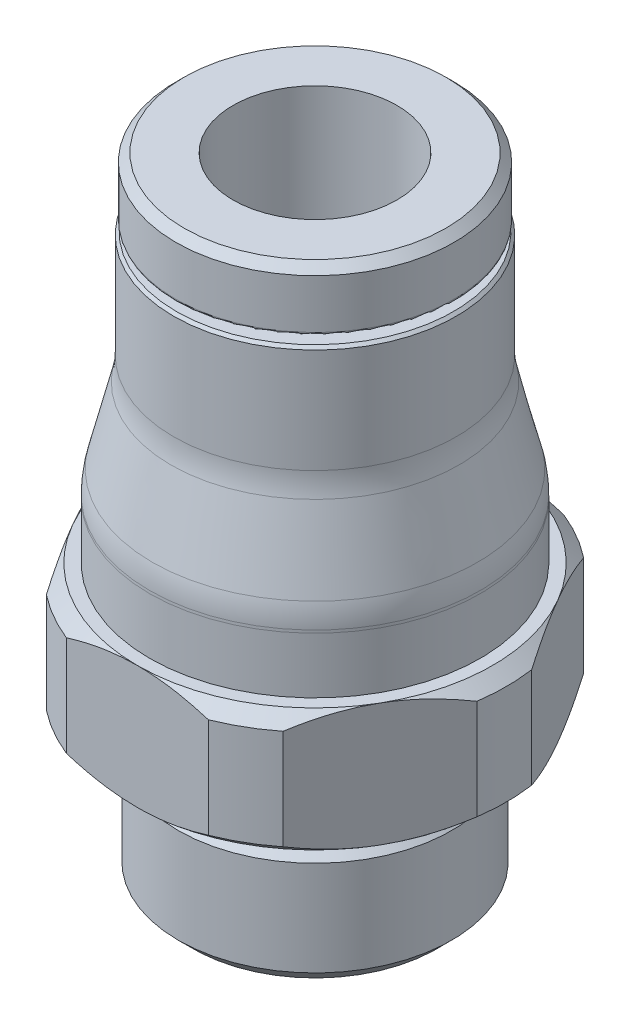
ISO-10303-21;
HEADER;
FILE_DESCRIPTION(('STEP AP214'),'2;1');
FILE_NAME('part.step','',(''),(''),'','','');
FILE_SCHEMA(('AUTOMOTIVE_DESIGN { 1 0 10303 214 1 1 1 1 }'));
ENDSEC;
DATA;
#1=APPLICATION_CONTEXT('core data for automotive mechanical design processes');
#2=APPLICATION_PROTOCOL_DEFINITION('international standard','automotive_design',2000,#1);
#3=PRODUCT_CONTEXT('',#1,'mechanical');
#4=PRODUCT('Part','Part','',(#3));
#5=PRODUCT_RELATED_PRODUCT_CATEGORY('part','',(#4));
#6=PRODUCT_DEFINITION_FORMATION('','',#4);
#7=PRODUCT_DEFINITION_CONTEXT('part definition',#1,'design');
#8=PRODUCT_DEFINITION('design','',#6,#7);
#9=PRODUCT_DEFINITION_SHAPE('','',#8);
#10=(LENGTH_UNIT() NAMED_UNIT(*) SI_UNIT(.MILLI.,.METRE.));
#11=(NAMED_UNIT(*) PLANE_ANGLE_UNIT() SI_UNIT($,.RADIAN.));
#12=(NAMED_UNIT(*) SI_UNIT($,.STERADIAN.) SOLID_ANGLE_UNIT());
#13=UNCERTAINTY_MEASURE_WITH_UNIT(LENGTH_MEASURE(1.E-05),#10,'distance_accuracy_value','');
#14=(GEOMETRIC_REPRESENTATION_CONTEXT(3) GLOBAL_UNCERTAINTY_ASSIGNED_CONTEXT((#13)) GLOBAL_UNIT_ASSIGNED_CONTEXT((#10,
#11,#12)) REPRESENTATION_CONTEXT('',''));
#15=CARTESIAN_POINT('',(0.,0.,0.));
#16=DIRECTION('',(0.,0.,1.));
#17=DIRECTION('',(1.,0.,0.));
#18=AXIS2_PLACEMENT_3D('',#15,#16,#17);
#19=CARTESIAN_POINT('',(-4.44089209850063E-13,2.24999999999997,-4.92661467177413E-13));
#20=DIRECTION('',(0.,-1.00000000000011,0.));
#21=DIRECTION('',(0.,0.,-1.00000000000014));
#22=AXIS2_PLACEMENT_3D('',#19,#20,#21);
#23=PLANE('',#22);
#24=CARTESIAN_POINT('',(-4.44089209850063E-13,2.24999999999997,-4.92661467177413E-13));
#25=DIRECTION('',(0.,1.00000000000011,0.));
#26=DIRECTION('',(1.,0.,0.));
#27=AXIS2_PLACEMENT_3D('',#24,#25,#26);
#28=CIRCLE('',#27,3.);
#29=CARTESIAN_POINT('',(2.99999999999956,2.2500000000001,-4.92659794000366E-13));
#30=VERTEX_POINT('',#29);
#31=EDGE_CURVE('E212',#30,#30,#28,.T.);
#32=ORIENTED_EDGE('',*,*,#31,.T.);
#33=EDGE_LOOP('',(#32));
#34=FACE_BOUND('',#33,.T.);
#35=DIRECTION('',(1.,0.,0.));
#36=VECTOR('',#35,1.);
#37=CARTESIAN_POINT('',(-5.93969318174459E-12,2.24999999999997,2.00000000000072));
#38=LINE('',#37,#36);
#39=CARTESIAN_POINT('',(-1.1547005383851,2.24999999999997,2.00000000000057));
#40=VERTEX_POINT('',#39);
#41=CARTESIAN_POINT('',(1.15470053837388,2.25000000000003,2.00000000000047));
#42=VERTEX_POINT('',#41);
#43=EDGE_CURVE('E186',#40,#42,#38,.T.);
#44=ORIENTED_EDGE('',*,*,#43,.F.);
#45=DIRECTION('',(0.500000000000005,0.,0.866025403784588));
#46=VECTOR('',#45,1.);
#47=CARTESIAN_POINT('',(-1.73205080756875,2.25000000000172,0.999999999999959));
#48=LINE('',#47,#46);
#49=CARTESIAN_POINT('',(-2.30940107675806,2.24999999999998,1.04083408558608E-13));
#50=VERTEX_POINT('',#49);
#51=EDGE_CURVE('E175',#50,#40,#48,.T.);
#52=ORIENTED_EDGE('',*,*,#51,.F.);
#53=DIRECTION('',(-0.500000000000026,0.,0.866025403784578));
#54=VECTOR('',#53,1.);
#55=CARTESIAN_POINT('',(-1.7320508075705,2.24999999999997,-0.999999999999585));
#56=LINE('',#55,#54);
#57=CARTESIAN_POINT('',(-1.1547005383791,2.25000000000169,-2.00000000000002));
#58=VERTEX_POINT('',#57);
#59=EDGE_CURVE('E180',#58,#50,#56,.T.);
#60=ORIENTED_EDGE('',*,*,#59,.F.);
#61=DIRECTION('',(-1.,0.,0.));
#62=VECTOR('',#61,1.);
#63=CARTESIAN_POINT('',(0.,2.25000000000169,-2.00000000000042));
#64=LINE('',#63,#62);
#65=CARTESIAN_POINT('',(1.15470053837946,2.25000000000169,-1.99999999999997));
#66=VERTEX_POINT('',#65);
#67=EDGE_CURVE('E462',#66,#58,#64,.T.);
#68=ORIENTED_EDGE('',*,*,#67,.F.);
#69=DIRECTION('',(-0.500000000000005,0.,-0.866025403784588));
#70=VECTOR('',#69,1.);
#71=CARTESIAN_POINT('',(1.732050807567,2.25000000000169,-0.999999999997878));
#72=LINE('',#71,#70);
#73=CARTESIAN_POINT('',(2.30940107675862,2.24999999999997,0.));
#74=VERTEX_POINT('',#73);
#75=EDGE_CURVE('E200',#74,#66,#72,.T.);
#76=ORIENTED_EDGE('',*,*,#75,.F.);
#77=DIRECTION('',(0.500000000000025,0.,-0.86602540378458));
#78=VECTOR('',#77,1.);
#79=CARTESIAN_POINT('',(1.73205080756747,2.25000000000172,1.00000000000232));
#80=LINE('',#79,#78);
#81=EDGE_CURVE('E194',#42,#74,#80,.T.);
#82=ORIENTED_EDGE('',*,*,#81,.F.);
#83=EDGE_LOOP('',(#44,#52,#60,#68,#76,#82));
#84=FACE_BOUND('',#83,.T.);
#85=ADVANCED_FACE('F17',(#34,#84),#23,.F.);
#86=CARTESIAN_POINT('',(2.4980018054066E-13,-5.4999999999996,0.));
#87=DIRECTION('',(0.,-1.00000000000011,0.));
#88=DIRECTION('',(0.,0.,-1.00000000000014));
#89=AXIS2_PLACEMENT_3D('',#86,#87,#88);
#90=PLANE('',#89);
#91=CARTESIAN_POINT('',(2.4980018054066E-13,-5.4999999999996,0.));
#92=DIRECTION('',(0.,-1.00000000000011,0.));
#93=DIRECTION('',(0.,0.,-1.00000000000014));
#94=AXIS2_PLACEMENT_3D('',#91,#92,#93);
#95=CIRCLE('',#94,4.45875);
#96=CARTESIAN_POINT('',(2.76776321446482E-13,-5.49999999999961,-4.45875000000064));
#97=VERTEX_POINT('',#96);
#98=EDGE_CURVE('E195',#97,#97,#95,.T.);
#99=ORIENTED_EDGE('',*,*,#98,.T.);
#100=EDGE_LOOP('',(#99));
#101=FACE_BOUND('',#100,.T.);
#102=DIRECTION('',(0.500000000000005,0.,0.866025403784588));
#103=VECTOR('',#102,1.);
#104=CARTESIAN_POINT('',(-1.73205080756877,-5.50000000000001,0.999999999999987));
#105=LINE('',#104,#103);
#106=CARTESIAN_POINT('',(-2.30940107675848,-5.4999999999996,-5.55111512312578E-13));
#107=VERTEX_POINT('',#106);
#108=CARTESIAN_POINT('',(-1.15470053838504,-5.49999999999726,2.00000000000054));
#109=VERTEX_POINT('',#108);
#110=EDGE_CURVE('E428',#107,#109,#105,.T.);
#111=ORIENTED_EDGE('',*,*,#110,.T.);
#112=DIRECTION('',(1.,0.,0.));
#113=VECTOR('',#112,1.);
#114=CARTESIAN_POINT('',(-5.38458166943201E-12,-5.49999999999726,2.0000000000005));
#115=LINE('',#114,#113);
#116=CARTESIAN_POINT('',(1.15470053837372,-5.49999999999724,2.00000000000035));
#117=VERTEX_POINT('',#116);
#118=EDGE_CURVE('E25',#109,#117,#115,.T.);
#119=ORIENTED_EDGE('',*,*,#118,.T.);
#120=DIRECTION('',(0.500000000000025,0.,-0.86602540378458));
#121=VECTOR('',#120,1.);
#122=CARTESIAN_POINT('',(1.73205080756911,-5.4999999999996,1.0000000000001));
#123=LINE('',#122,#121);
#124=CARTESIAN_POINT('',(2.30940107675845,-5.4999999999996,-3.12250225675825E-13));
#125=VERTEX_POINT('',#124);
#126=EDGE_CURVE('E441',#117,#125,#123,.T.);
#127=ORIENTED_EDGE('',*,*,#126,.T.);
#128=DIRECTION('',(-0.500000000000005,0.,-0.866025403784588));
#129=VECTOR('',#128,1.);
#130=CARTESIAN_POINT('',(1.73205080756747,-5.49999999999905,-0.999999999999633));
#131=LINE('',#130,#129);
#132=CARTESIAN_POINT('',(1.15470053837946,-5.49999999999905,-1.99999999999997));
#133=VERTEX_POINT('',#132);
#134=EDGE_CURVE('E438',#125,#133,#131,.T.);
#135=ORIENTED_EDGE('',*,*,#134,.T.);
#136=DIRECTION('',(-1.,0.,0.));
#137=VECTOR('',#136,1.);
#138=CARTESIAN_POINT('',(2.77555756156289E-13,-5.49999999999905,-2.));
#139=LINE('',#138,#137);
#140=CARTESIAN_POINT('',(-1.15470053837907,-5.49999999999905,-2.00000000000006));
#141=VERTEX_POINT('',#140);
#142=EDGE_CURVE('E435',#133,#141,#139,.T.);
#143=ORIENTED_EDGE('',*,*,#142,.T.);
#144=DIRECTION('',(-0.500000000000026,0.,0.866025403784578));
#145=VECTOR('',#144,1.);
#146=CARTESIAN_POINT('',(-1.7320508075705,-5.4999999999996,-0.999999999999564));
#147=LINE('',#146,#145);
#148=EDGE_CURVE('E432',#141,#107,#147,.T.);
#149=ORIENTED_EDGE('',*,*,#148,.T.);
#150=EDGE_LOOP('',(#111,#119,#127,#135,#143,#149));
#151=FACE_BOUND('',#150,.T.);
#152=ADVANCED_FACE('F444',(#101,#151),#90,.T.);
#153=CARTESIAN_POINT('',(4.16333634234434E-13,17.5000000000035,-8.74300631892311E-13));
#154=DIRECTION('',(0.,-1.00000000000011,0.));
#155=DIRECTION('',(0.,0.,1.00000000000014));
#156=AXIS2_PLACEMENT_3D('',#153,#154,#155);
#157=CYLINDRICAL_SURFACE('',#156,6.05);
#158=CARTESIAN_POINT('',(1.38777878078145E-13,6.55000000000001,0.));
#159=DIRECTION('',(0.,-1.00000000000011,0.));
#160=DIRECTION('',(0.,0.,1.00000000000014));
#161=AXIS2_PLACEMENT_3D('',#158,#159,#160);
#162=CIRCLE('',#161,6.05);
#163=CARTESIAN_POINT('',(1.0217442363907E-13,6.55000000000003,6.05000000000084));
#164=VERTEX_POINT('',#163);
#165=EDGE_CURVE('E422',#164,#164,#162,.T.);
#166=ORIENTED_EDGE('',*,*,#165,.F.);
#167=EDGE_LOOP('',(#166));
#168=FACE_BOUND('',#167,.T.);
#169=CARTESIAN_POINT('',(1.38777878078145E-13,6.65,0.));
#170=DIRECTION('',(0.,-1.00000000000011,0.));
#171=DIRECTION('',(0.,0.,1.00000000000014));
#172=AXIS2_PLACEMENT_3D('',#169,#170,#171);
#173=CIRCLE('',#172,6.05);
#174=CARTESIAN_POINT('',(1.0217442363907E-13,6.65000000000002,6.05000000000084));
#175=VERTEX_POINT('',#174);
#176=EDGE_CURVE('E419',#175,#175,#173,.T.);
#177=ORIENTED_EDGE('',*,*,#176,.T.);
#178=EDGE_LOOP('',(#177));
#179=FACE_BOUND('',#178,.T.);
#180=ADVANCED_FACE('F19',(#168,#179),#157,.T.);
#181=CARTESIAN_POINT('',(1.38777878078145E-13,6.65,0.));
#182=DIRECTION('',(0.,-1.00000000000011,0.));
#183=DIRECTION('',(0.,0.,1.00000000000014));
#184=AXIS2_PLACEMENT_3D('',#181,#182,#183);
#185=DEGENERATE_TOROIDAL_SURFACE('',#184,2.53,3.52,.T.);
#186=ORIENTED_EDGE('',*,*,#176,.F.);
#187=EDGE_LOOP('',(#186));
#188=FACE_BOUND('',#187,.T.);
#189=CARTESIAN_POINT('',(-4.44089209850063E-13,7.49097737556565,-4.92661467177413E-13));
#190=DIRECTION('',(0.,-1.00000000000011,0.));
#191=DIRECTION('',(0.,0.,1.00000000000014));
#192=AXIS2_PLACEMENT_3D('',#189,#190,#191);
#193=CIRCLE('',#192,5.94806334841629);
#194=CARTESIAN_POINT('',(-4.8007593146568E-13,7.49097737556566,5.94806334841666));
#195=VERTEX_POINT('',#194);
#196=EDGE_CURVE('E416',#195,#195,#193,.T.);
#197=ORIENTED_EDGE('',*,*,#196,.T.);
#198=EDGE_LOOP('',(#197));
#199=FACE_BOUND('',#198,.T.);
#200=ADVANCED_FACE('F559',(#188,#199),#185,.T.);
#201=CARTESIAN_POINT('',(-4.44089209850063E-13,7.49097737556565,-4.92661467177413E-13));
#202=DIRECTION('',(0.,-1.00000000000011,0.));
#203=DIRECTION('',(0.,0.,1.00000000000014));
#204=AXIS2_PLACEMENT_3D('',#201,#202,#203);
#205=CONICAL_SURFACE('',#204,5.94806334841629,0.241247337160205);
#206=CARTESIAN_POINT('',(1.94289029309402E-13,10.2390226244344,3.05311331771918E-13));
#207=DIRECTION('',(0.,-1.00000000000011,0.));
#208=DIRECTION('',(0.,0.,1.00000000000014));
#209=AXIS2_PLACEMENT_3D('',#206,#207,#208);
#210=CIRCLE('',#209,5.27193665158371);
#211=CARTESIAN_POINT('',(1.62392980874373E-13,10.2390226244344,5.27193665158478));
#212=VERTEX_POINT('',#211);
#213=EDGE_CURVE('E413',#212,#212,#210,.T.);
#214=ORIENTED_EDGE('',*,*,#213,.T.);
#215=EDGE_LOOP('',(#214));
#216=FACE_BOUND('',#215,.T.);
#217=ORIENTED_EDGE('',*,*,#196,.F.);
#218=EDGE_LOOP('',(#217));
#219=FACE_BOUND('',#218,.T.);
#220=ADVANCED_FACE('F556',(#216,#219),#205,.T.);
#221=CARTESIAN_POINT('',(1.94289029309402E-13,11.08,2.91433543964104E-13));
#222=DIRECTION('',(0.,-1.00000000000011,0.));
#223=DIRECTION('',(0.,0.,1.00000000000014));
#224=AXIS2_PLACEMENT_3D('',#221,#222,#223);
#225=TOROIDAL_SURFACE('',#224,8.69,3.52);
#226=CARTESIAN_POINT('',(1.94289029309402E-13,11.08,2.91433543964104E-13));
#227=DIRECTION('',(0.,-1.00000000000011,0.));
#228=DIRECTION('',(0.,0.,1.00000000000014));
#229=AXIS2_PLACEMENT_3D('',#226,#227,#228);
#230=CIRCLE('',#229,5.17);
#231=CARTESIAN_POINT('',(1.6300971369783E-13,11.08,5.17000000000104));
#232=VERTEX_POINT('',#231);
#233=EDGE_CURVE('E410',#232,#232,#230,.T.);
#234=ORIENTED_EDGE('',*,*,#233,.T.);
#235=EDGE_LOOP('',(#234));
#236=FACE_BOUND('',#235,.T.);
#237=ORIENTED_EDGE('',*,*,#213,.F.);
#238=EDGE_LOOP('',(#237));
#239=FACE_BOUND('',#238,.T.);
#240=ADVANCED_FACE('F552',(#236,#239),#225,.F.);
#241=CARTESIAN_POINT('',(4.16333634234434E-13,17.5000000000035,-8.74300631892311E-13));
#242=DIRECTION('',(0.,-1.00000000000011,0.));
#243=DIRECTION('',(0.,0.,1.00000000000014));
#244=AXIS2_PLACEMENT_3D('',#241,#242,#243);
#245=CYLINDRICAL_SURFACE('',#244,5.17);
#246=CARTESIAN_POINT('',(1.94289029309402E-13,14.9000000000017,3.05311331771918E-13));
#247=DIRECTION('',(0.,-1.00000000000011,0.));
#248=DIRECTION('',(0.,0.,1.00000000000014));
#249=AXIS2_PLACEMENT_3D('',#246,#247,#248);
#250=CIRCLE('',#249,5.17);
#251=CARTESIAN_POINT('',(1.6300971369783E-13,14.9000000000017,5.17000000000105));
#252=VERTEX_POINT('',#251);
#253=EDGE_CURVE('E407',#252,#252,#250,.T.);
#254=ORIENTED_EDGE('',*,*,#253,.T.);
#255=EDGE_LOOP('',(#254));
#256=FACE_BOUND('',#255,.T.);
#257=ORIENTED_EDGE('',*,*,#233,.F.);
#258=EDGE_LOOP('',(#257));
#259=FACE_BOUND('',#258,.T.);
#260=ADVANCED_FACE('F548',(#256,#259),#245,.T.);
#261=CARTESIAN_POINT('',(1.94289029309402E-13,15.0000000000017,3.05311331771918E-13));
#262=DIRECTION('',(0.,-1.00000000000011,0.));
#263=DIRECTION('',(0.,0.,1.00000000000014));
#264=AXIS2_PLACEMENT_3D('',#261,#262,#263);
#265=CONICAL_SURFACE('',#264,5.07,0.785398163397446);
#266=ORIENTED_EDGE('',*,*,#253,.F.);
#267=EDGE_LOOP('',(#266));
#268=FACE_BOUND('',#267,.T.);
#269=CARTESIAN_POINT('',(1.94289029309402E-13,15.0000000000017,3.05311331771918E-13));
#270=DIRECTION('',(0.,-1.00000000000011,0.));
#271=DIRECTION('',(0.,0.,1.00000000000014));
#272=AXIS2_PLACEMENT_3D('',#269,#270,#271);
#273=CIRCLE('',#272,5.07);
#274=CARTESIAN_POINT('',(1.63614729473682E-13,15.0000000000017,5.07000000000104));
#275=VERTEX_POINT('',#274);
#276=EDGE_CURVE('E404',#275,#275,#273,.T.);
#277=ORIENTED_EDGE('',*,*,#276,.T.);
#278=EDGE_LOOP('',(#277));
#279=FACE_BOUND('',#278,.T.);
#280=ADVANCED_FACE('F544',(#268,#279),#265,.T.);
#281=CARTESIAN_POINT('',(-4.49999999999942,15.0000000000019,-1.59594559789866E-13));
#282=DIRECTION('',(0.,-1.00000000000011,0.));
#283=DIRECTION('',(0.,0.,1.00000000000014));
#284=AXIS2_PLACEMENT_3D('',#281,#282,#283);
#285=PLANE('',#284);
#286=ORIENTED_EDGE('',*,*,#276,.F.);
#287=EDGE_LOOP('',(#286));
#288=FACE_BOUND('',#287,.T.);
#289=CARTESIAN_POINT('',(1.94289029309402E-13,15.0000000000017,3.05311331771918E-13));
#290=DIRECTION('',(0.,-1.00000000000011,0.));
#291=DIRECTION('',(0.,0.,1.00000000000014));
#292=AXIS2_PLACEMENT_3D('',#289,#290,#291);
#293=CIRCLE('',#292,4.5);
#294=CARTESIAN_POINT('',(1.67063319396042E-13,15.0000000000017,4.50000000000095));
#295=VERTEX_POINT('',#294);
#296=EDGE_CURVE('E401',#295,#295,#293,.T.);
#297=ORIENTED_EDGE('',*,*,#296,.T.);
#298=EDGE_LOOP('',(#297));
#299=FACE_BOUND('',#298,.T.);
#300=ADVANCED_FACE('F540',(#288,#299),#285,.F.);
#301=CARTESIAN_POINT('',(4.16333634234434E-13,17.5000000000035,-8.74300631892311E-13));
#302=DIRECTION('',(0.,-1.00000000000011,0.));
#303=DIRECTION('',(0.,0.,1.00000000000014));
#304=AXIS2_PLACEMENT_3D('',#301,#302,#303);
#305=CYLINDRICAL_SURFACE('',#304,4.5);
#306=ORIENTED_EDGE('',*,*,#296,.F.);
#307=EDGE_LOOP('',(#306));
#308=FACE_BOUND('',#307,.T.);
#309=CARTESIAN_POINT('',(1.94289029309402E-13,15.3000000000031,3.05311331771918E-13));
#310=DIRECTION('',(0.,-1.00000000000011,0.));
#311=DIRECTION('',(0.,0.,1.00000000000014));
#312=AXIS2_PLACEMENT_3D('',#309,#310,#311);
#313=CIRCLE('',#312,4.5);
#314=CARTESIAN_POINT('',(1.67063319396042E-13,15.3000000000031,4.50000000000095));
#315=VERTEX_POINT('',#314);
#316=EDGE_CURVE('E398',#315,#315,#313,.T.);
#317=ORIENTED_EDGE('',*,*,#316,.T.);
#318=EDGE_LOOP('',(#317));
#319=FACE_BOUND('',#318,.T.);
#320=ADVANCED_FACE('F536',(#308,#319),#305,.T.);
#321=CARTESIAN_POINT('',(-4.49999999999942,15.3000000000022,-1.59594559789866E-13));
#322=DIRECTION('',(0.,-1.00000000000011,0.));
#323=DIRECTION('',(0.,0.,1.00000000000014));
#324=AXIS2_PLACEMENT_3D('',#321,#322,#323);
#325=PLANE('',#324);
#326=CARTESIAN_POINT('',(1.94289029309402E-13,15.3000000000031,3.05311331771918E-13));
#327=DIRECTION('',(0.,-1.00000000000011,0.));
#328=DIRECTION('',(0.,0.,1.00000000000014));
#329=AXIS2_PLACEMENT_3D('',#326,#327,#328);
#330=CIRCLE('',#329,4.99);
#331=CARTESIAN_POINT('',(1.64098742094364E-13,15.3000000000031,4.99000000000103));
#332=VERTEX_POINT('',#331);
#333=EDGE_CURVE('E395',#332,#332,#330,.T.);
#334=ORIENTED_EDGE('',*,*,#333,.T.);
#335=EDGE_LOOP('',(#334));
#336=FACE_BOUND('',#335,.T.);
#337=ORIENTED_EDGE('',*,*,#316,.F.);
#338=EDGE_LOOP('',(#337));
#339=FACE_BOUND('',#338,.T.);
#340=ADVANCED_FACE('F532',(#336,#339),#325,.T.);
#341=CARTESIAN_POINT('',(1.94289029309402E-13,15.4000000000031,3.05311331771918E-13));
#342=DIRECTION('',(0.,-1.00000000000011,0.));
#343=DIRECTION('',(0.,0.,1.00000000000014));
#344=AXIS2_PLACEMENT_3D('',#341,#342,#343);
#345=TOROIDAL_SURFACE('',#344,4.99,0.1);
#346=ORIENTED_EDGE('',*,*,#333,.F.);
#347=EDGE_LOOP('',(#346));
#348=FACE_BOUND('',#347,.T.);
#349=CARTESIAN_POINT('',(1.94289029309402E-13,15.4000000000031,3.05311331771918E-13));
#350=DIRECTION('',(0.,-1.00000000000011,0.));
#351=DIRECTION('',(0.,0.,1.00000000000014));
#352=AXIS2_PLACEMENT_3D('',#349,#350,#351);
#353=CIRCLE('',#352,5.09);
#354=CARTESIAN_POINT('',(1.63493726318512E-13,15.4000000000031,5.09000000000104));
#355=VERTEX_POINT('',#354);
#356=EDGE_CURVE('E392',#355,#355,#353,.T.);
#357=ORIENTED_EDGE('',*,*,#356,.T.);
#358=EDGE_LOOP('',(#357));
#359=FACE_BOUND('',#358,.T.);
#360=ADVANCED_FACE('F525',(#348,#359),#345,.T.);
#361=CARTESIAN_POINT('',(4.16333634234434E-13,17.5000000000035,-8.74300631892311E-13));
#362=DIRECTION('',(0.,-1.00000000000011,0.));
#363=DIRECTION('',(0.,0.,1.00000000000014));
#364=AXIS2_PLACEMENT_3D('',#361,#362,#363);
#365=CYLINDRICAL_SURFACE('',#364,5.09);
#366=ORIENTED_EDGE('',*,*,#356,.F.);
#367=EDGE_LOOP('',(#366));
#368=FACE_BOUND('',#367,.T.);
#369=CARTESIAN_POINT('',(4.16333634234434E-13,17.2000000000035,-8.74300631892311E-13));
#370=DIRECTION('',(0.,-1.00000000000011,0.));
#371=DIRECTION('',(0.,0.,1.00000000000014));
#372=AXIS2_PLACEMENT_3D('',#369,#370,#371);
#373=CIRCLE('',#372,5.09);
#374=CARTESIAN_POINT('',(3.85538331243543E-13,17.2000000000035,5.08999999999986));
#375=VERTEX_POINT('',#374);
#376=EDGE_CURVE('E389',#375,#375,#373,.T.);
#377=ORIENTED_EDGE('',*,*,#376,.T.);
#378=EDGE_LOOP('',(#377));
#379=FACE_BOUND('',#378,.T.);
#380=ADVANCED_FACE('F519',(#368,#379),#365,.T.);
#381=CARTESIAN_POINT('',(4.16333634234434E-13,17.5000000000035,-8.74300631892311E-13));
#382=DIRECTION('',(0.,-1.00000000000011,0.));
#383=DIRECTION('',(0.,0.,1.00000000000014));
#384=AXIS2_PLACEMENT_3D('',#381,#382,#383);
#385=CONICAL_SURFACE('',#384,4.79,0.785398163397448);
#386=ORIENTED_EDGE('',*,*,#376,.F.);
#387=EDGE_LOOP('',(#386));
#388=FACE_BOUND('',#387,.T.);
#389=CARTESIAN_POINT('',(4.16333634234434E-13,17.5000000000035,-8.74300631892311E-13));
#390=DIRECTION('',(0.,-1.00000000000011,0.));
#391=DIRECTION('',(0.,0.,1.00000000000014));
#392=AXIS2_PLACEMENT_3D('',#389,#390,#391);
#393=CIRCLE('',#392,4.79);
#394=CARTESIAN_POINT('',(3.87353378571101E-13,17.5000000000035,4.78999999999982));
#395=VERTEX_POINT('',#394);
#396=EDGE_CURVE('E386',#395,#395,#393,.T.);
#397=ORIENTED_EDGE('',*,*,#396,.T.);
#398=EDGE_LOOP('',(#397));
#399=FACE_BOUND('',#398,.T.);
#400=ADVANCED_FACE('F514',(#388,#399),#385,.T.);
#401=CARTESIAN_POINT('',(4.16333634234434E-13,17.5000000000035,-8.74300631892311E-13));
#402=DIRECTION('',(0.,-1.00000000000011,0.));
#403=DIRECTION('',(0.,0.,1.00000000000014));
#404=AXIS2_PLACEMENT_3D('',#401,#402,#403);
#405=PLANE('',#404);
#406=CARTESIAN_POINT('',(4.16333634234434E-13,17.5000000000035,-8.74300631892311E-13));
#407=DIRECTION('',(0.,-1.00000000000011,0.));
#408=DIRECTION('',(1.,0.,0.));
#409=AXIS2_PLACEMENT_3D('',#406,#407,#408);
#410=CIRCLE('',#409,3.);
#411=CARTESIAN_POINT('',(3.00000000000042,17.5000000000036,-8.74298958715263E-13));
#412=VERTEX_POINT('',#411);
#413=EDGE_CURVE('E215',#412,#412,#410,.T.);
#414=ORIENTED_EDGE('',*,*,#413,.T.);
#415=EDGE_LOOP('',(#414));
#416=FACE_BOUND('',#415,.T.);
#417=ORIENTED_EDGE('',*,*,#396,.F.);
#418=EDGE_LOOP('',(#417));
#419=FACE_BOUND('',#418,.T.);
#420=ADVANCED_FACE('F510',(#416,#419),#405,.F.);
#421=CARTESIAN_POINT('',(-4.44089209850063E-13,2.24999999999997,-4.92661467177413E-13));
#422=DIRECTION('',(0.,1.00000000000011,0.));
#423=DIRECTION('',(1.,0.,0.));
#424=AXIS2_PLACEMENT_3D('',#421,#422,#423);
#425=CYLINDRICAL_SURFACE('',#424,6.05);
#426=CARTESIAN_POINT('',(3.60822483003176E-13,4.49999999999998,0.));
#427=DIRECTION('',(0.,1.00000000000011,0.));
#428=DIRECTION('',(0.,0.,1.00000000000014));
#429=AXIS2_PLACEMENT_3D('',#426,#427,#428);
#430=CIRCLE('',#429,6.05);
#431=CARTESIAN_POINT('',(3.24219028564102E-13,4.5,6.05000000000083));
#432=VERTEX_POINT('',#431);
#433=EDGE_CURVE('E425',#432,#432,#430,.F.);
#434=ORIENTED_EDGE('',*,*,#433,.F.);
#435=EDGE_LOOP('',(#434));
#436=FACE_BOUND('',#435,.T.);
#437=ORIENTED_EDGE('',*,*,#165,.T.);
#438=EDGE_LOOP('',(#437));
#439=FACE_BOUND('',#438,.T.);
#440=ADVANCED_FACE('F513',(#436,#439),#425,.T.);
#441=CARTESIAN_POINT('',(3.60822483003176E-13,3.65460712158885,0.));
#442=DIRECTION('',(0.,-1.00000000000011,0.));
#443=DIRECTION('',(0.,0.,-1.00000000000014));
#444=AXIS2_PLACEMENT_3D('',#441,#442,#443);
#445=CONICAL_SURFACE('',#444,7.5075,0.872664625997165);
#446=CARTESIAN_POINT('',(-7.50555361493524,3.65624033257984,-1.99999947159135E-07));
#447=CARTESIAN_POINT('',(-7.37923534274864,3.76218215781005,0.218789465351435));
#448=CARTESIAN_POINT('',(-7.25137520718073,3.86149851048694,0.440249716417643));
#449=CARTESIAN_POINT('',(-6.99221699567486,4.04306209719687,0.889124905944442));
#450=CARTESIAN_POINT('',(-6.86090911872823,4.12525295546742,1.11655682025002));
#451=CARTESIAN_POINT('',(-6.59653737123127,4.26735308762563,1.57446211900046));
#452=CARTESIAN_POINT('',(-6.4635006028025,4.32745956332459,1.8048885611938));
#453=CARTESIAN_POINT('',(-6.19527246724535,4.42223143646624,2.26947331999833));
#454=CARTESIAN_POINT('',(-6.06008393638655,4.45692788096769,2.5036267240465));
#455=CARTESIAN_POINT('',(-5.85536464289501,4.48803027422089,2.85821094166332));
#456=CARTESIAN_POINT('',(-5.78620237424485,4.49487314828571,2.97800350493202));
#457=CARTESIAN_POINT('',(-5.64779033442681,4.50114414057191,3.21774019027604));
#458=CARTESIAN_POINT('',(-5.57854056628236,4.50057250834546,3.33768430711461));
#459=CARTESIAN_POINT('',(-5.44013096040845,4.49201542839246,3.57741677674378));
#460=CARTESIAN_POINT('',(-5.3709711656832,4.48402722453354,3.69720505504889));
#461=CARTESIAN_POINT('',(-5.2329514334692,4.46082848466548,3.93626224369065));
#462=CARTESIAN_POINT('',(-5.16409153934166,4.44561693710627,4.05553107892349));
#463=CARTESIAN_POINT('',(-4.95825250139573,4.38962421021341,4.41205475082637));
#464=CARTESIAN_POINT('',(-4.82195716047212,4.33848098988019,4.64812520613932));
#465=CARTESIAN_POINT('',(-4.55215268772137,4.21244817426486,5.11544026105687));
#466=CARTESIAN_POINT('',(-4.41864476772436,4.13754847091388,5.34668276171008));
#467=CARTESIAN_POINT('',(-4.24141554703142,4.02399944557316,5.65365277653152));
#468=CARTESIAN_POINT('',(-4.19628936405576,3.99383232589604,5.73181361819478));
#469=CARTESIAN_POINT('',(-4.10641973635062,3.93140371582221,5.88747237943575));
#470=CARTESIAN_POINT('',(-4.06167613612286,3.89914312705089,5.96497056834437));
#471=CARTESIAN_POINT('',(-3.97271042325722,3.83280008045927,6.11906370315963));
#472=CARTESIAN_POINT('',(-3.92848702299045,3.79872449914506,6.19566087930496));
#473=CARTESIAN_POINT('',(-3.84037718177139,3.72878451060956,6.34827160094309));
#474=CARTESIAN_POINT('',(-3.79649086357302,3.69291948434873,6.42428493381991));
#475=CARTESIAN_POINT('',(-3.75277663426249,3.65624033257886,6.50000020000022));
#476=B_SPLINE_CURVE_WITH_KNOTS('',3,(#446,#447,#448,#449,#450,#451,#452,#453,#454,#455,#456,
#457,#458,#459,#460,#461,#462,#463,#464,#465,#466,#467,#468,#469,#470,#471,#472,#473,#474,#475),
.UNSPECIFIED.,.F.,.F.,(4,2,2,2,2,2,2,2,2,2,2,2,2,2,4),(0.,0.822185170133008,1.64703557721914,
2.46433040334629,3.28062495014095,3.69593559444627,4.11123226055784,4.52668332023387,
4.94219257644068,5.77287147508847,6.60390429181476,6.88937228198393,7.17471813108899,
7.45905068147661,7.74348228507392),.UNSPECIFIED.);
#477=CARTESIAN_POINT('',(-5.62916512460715,4.50000000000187,3.25000000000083));
#478=VERTEX_POINT('',#477);
#479=CARTESIAN_POINT('',(-4.33012701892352,4.08045018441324,5.50000000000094));
#480=VERTEX_POINT('',#479);
#481=EDGE_CURVE('E599',#478,#480,#476,.T.);
#482=ORIENTED_EDGE('',*,*,#481,.T.);
#483=CARTESIAN_POINT('',(3.60822483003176E-13,4.08045018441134,0.));
#484=DIRECTION('',(0.,-1.00000000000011,0.));
#485=DIRECTION('',(0.,0.,-1.00000000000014));
#486=AXIS2_PLACEMENT_3D('',#483,#484,#485);
#487=CIRCLE('',#486,7.);
#488=CARTESIAN_POINT('',(-2.59807621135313,4.08045018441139,6.50000000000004));
#489=VERTEX_POINT('',#488);
#490=EDGE_CURVE('E270',#480,#489,#487,.F.);
#491=ORIENTED_EDGE('',*,*,#490,.T.);
#492=CARTESIAN_POINT('',(-8.40466386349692,1.03880288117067,6.50000000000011));
#493=CARTESIAN_POINT('',(-8.19021458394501,1.18111120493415,6.50000000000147));
#494=CARTESIAN_POINT('',(-7.97484577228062,1.32205645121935,6.50000000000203));
#495=CARTESIAN_POINT('',(-7.54186859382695,1.60056511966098,6.50000000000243));
#496=CARTESIAN_POINT('',(-7.32425974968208,1.73812779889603,6.50000000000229));
#497=CARTESIAN_POINT('',(-6.88496522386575,2.01010025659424,6.50000000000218));
#498=CARTESIAN_POINT('',(-6.66326167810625,2.14448127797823,6.50000000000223));
#499=CARTESIAN_POINT('',(-6.21684315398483,2.40812789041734,6.50000000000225));
#500=CARTESIAN_POINT('',(-5.99212836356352,2.53739379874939,6.50000000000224));
#501=CARTESIAN_POINT('',(-5.52728399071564,2.79622679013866,6.50000000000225));
#502=CARTESIAN_POINT('',(-5.28696415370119,2.92545396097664,6.50000000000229));
#503=CARTESIAN_POINT('',(-4.80171418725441,3.17508951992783,6.50000000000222));
#504=CARTESIAN_POINT('',(-4.55678340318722,3.29549664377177,6.50000000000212));
#505=CARTESIAN_POINT('',(-4.0623209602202,3.52475502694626,6.5000000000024));
#506=CARTESIAN_POINT('',(-3.81280331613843,3.63363625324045,6.50000000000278));
#507=CARTESIAN_POINT('',(-3.30805438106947,3.83710161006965,6.50000000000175));
#508=CARTESIAN_POINT('',(-3.05282544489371,3.93169151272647,6.50000000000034));
#509=CARTESIAN_POINT('',(-2.54050675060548,4.10148058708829,6.50000000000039));
#510=CARTESIAN_POINT('',(-2.28351449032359,4.17696966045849,6.50000000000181));
#511=CARTESIAN_POINT('',(-1.76409658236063,4.30652399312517,6.50000000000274));
#512=CARTESIAN_POINT('',(-1.50167128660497,4.36059063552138,6.50000000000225));
#513=CARTESIAN_POINT('',(-0.977657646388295,4.44279724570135,6.50000000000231));
#514=CARTESIAN_POINT('',(-0.716142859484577,4.47139625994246,6.50000000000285));
#515=CARTESIAN_POINT('',(-0.191543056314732,4.50204649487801,6.50000000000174));
#516=CARTESIAN_POINT('',(0.0715417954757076,4.50410044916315,6.5000000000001));
#517=CARTESIAN_POINT('',(0.578122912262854,4.48229717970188,6.5000000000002));
#518=CARTESIAN_POINT('',(0.821700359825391,4.4602450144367,6.50000000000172));
#519=CARTESIAN_POINT('',(1.30589893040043,4.39463056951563,6.50000000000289));
#520=CARTESIAN_POINT('',(1.54651984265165,4.35106676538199,6.50000000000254));
#521=CARTESIAN_POINT('',(2.02852331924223,4.2439711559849,6.50000000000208));
#522=CARTESIAN_POINT('',(2.2698159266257,4.18003954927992,6.50000000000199));
#523=CARTESIAN_POINT('',(2.62792383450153,4.07185158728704,6.50000000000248));
#524=CARTESIAN_POINT('',(2.74665041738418,4.03374210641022,6.50000000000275));
#525=CARTESIAN_POINT('',(2.9828440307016,3.95381141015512,6.50000000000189));
#526=CARTESIAN_POINT('',(3.1003111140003,3.91199035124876,6.50000000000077));
#527=CARTESIAN_POINT('',(3.4492992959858,3.78209554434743,6.49999999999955));
#528=CARTESIAN_POINT('',(3.67899451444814,3.68910020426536,6.50000000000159));
#529=CARTESIAN_POINT('',(4.13383062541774,3.49250595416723,6.50000000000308));
#530=CARTESIAN_POINT('',(4.35897002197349,3.38890362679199,6.50000000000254));
#531=CARTESIAN_POINT('',(4.80539760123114,3.17307383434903,6.50000000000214));
#532=CARTESIAN_POINT('',(5.0266806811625,3.06083586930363,6.50000000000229));
#533=CARTESIAN_POINT('',(5.4655969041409,2.82952486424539,6.5000000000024));
#534=CARTESIAN_POINT('',(5.68323041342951,2.71045251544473,6.50000000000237));
#535=CARTESIAN_POINT('',(6.11673297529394,2.46598825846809,6.50000000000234));
#536=CARTESIAN_POINT('',(6.33258200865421,2.34056098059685,6.50000000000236));
#537=CARTESIAN_POINT('',(6.76154862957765,2.08512364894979,6.50000000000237));
#538=CARTESIAN_POINT('',(6.97466616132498,1.95511350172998,6.50000000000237));
#539=CARTESIAN_POINT('',(7.39841111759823,1.69141027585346,6.50000000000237));
#540=CARTESIAN_POINT('',(7.60904008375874,1.5577196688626,6.50000000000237));
#541=CARTESIAN_POINT('',(8.02827887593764,1.28720561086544,6.50000000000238));
#542=CARTESIAN_POINT('',(8.23688865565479,1.15038208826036,6.50000000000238));
#543=CARTESIAN_POINT('',(8.8151371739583,0.765895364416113,6.50000000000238));
#544=CARTESIAN_POINT('',(9.18288083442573,0.515382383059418,6.50000000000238));
#545=CARTESIAN_POINT('',(9.91413126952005,0.0081517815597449,6.50000000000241));
#546=CARTESIAN_POINT('',(10.2776373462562,-0.248566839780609,6.50000000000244));
#547=CARTESIAN_POINT('',(10.9963711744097,-0.763213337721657,6.50000000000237));
#548=CARTESIAN_POINT('',(11.3516443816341,-1.0210778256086,6.50000000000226));
#549=CARTESIAN_POINT('',(11.8825284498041,-1.41053119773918,6.50000000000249));
#550=CARTESIAN_POINT('',(12.0591293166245,-1.5407746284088,6.50000000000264));
#551=CARTESIAN_POINT('',(12.4117342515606,-1.80206395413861,6.50000000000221));
#552=CARTESIAN_POINT('',(12.5877383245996,-1.93310984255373,6.50000000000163));
#553=CARTESIAN_POINT('',(12.7634768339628,-2.06451109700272,6.50000000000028));
#554=B_SPLINE_CURVE_WITH_KNOTS('',3,(#492,#493,#494,#495,#496,#497,#498,#499,#500,#501,#502,
#503,#504,#505,#506,#507,#508,#509,#510,#511,#512,#513,#514,#515,#516,#517,#518,#519,#520,#521,
#522,#523,#524,#525,#526,#527,#528,#529,#530,#531,#532,#533,#534,#535,#536,#537,#538,#539,#540,
#541,#542,#543,#544,#545,#546,#547,#548,#549,#550,#551,#552,#553),.UNSPECIFIED.,.F.,.F.,(4,2,2,
2,2,2,2,2,2,2,2,2,2,2,2,2,2,2,2,2,2,2,2,2,2,2,2,2,2,2,4),(0.,0.772128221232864,1.54442453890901,
2.32211874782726,3.09976464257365,3.91820381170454,4.73676006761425,5.55313294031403,
6.36917520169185,7.1719677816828,7.97470852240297,8.76266875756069,9.55054784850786,
10.2832341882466,11.0159724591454,11.7640855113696,12.1381150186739,12.5121287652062,
13.2551810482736,13.9984734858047,14.7426844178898,15.4868202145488,16.2356877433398,
16.9845705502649,17.7329621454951,18.4813708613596,19.8161646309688,21.1511752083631,
22.4681177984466,23.1264176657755,23.7847120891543),.UNSPECIFIED.);
#555=CARTESIAN_POINT('',(1.94289029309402E-13,4.50000000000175,6.5000000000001));
#556=VERTEX_POINT('',#555);
#557=EDGE_CURVE('E372',#489,#556,#554,.T.);
#558=ORIENTED_EDGE('',*,*,#557,.T.);
#559=CARTESIAN_POINT('',(3.60822483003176E-13,4.49999999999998,0.));
#560=DIRECTION('',(0.,1.00000000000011,0.));
#561=DIRECTION('',(0.,0.,1.00000000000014));
#562=AXIS2_PLACEMENT_3D('',#559,#560,#561);
#563=CIRCLE('',#562,6.5);
#564=EDGE_CURVE('E378',#478,#556,#563,.T.);
#565=ORIENTED_EDGE('',*,*,#564,.F.);
#566=EDGE_LOOP('',(#482,#491,#558,#565));
#567=FACE_BOUND('',#566,.T.);
#568=ADVANCED_FACE('F307',(#567),#445,.T.);
#569=CARTESIAN_POINT('',(-3.75277663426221,3.65624033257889,-6.50000020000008));
#570=CARTESIAN_POINT('',(-3.87909490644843,3.76218215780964,-6.28121053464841));
#571=CARTESIAN_POINT('',(-4.00695504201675,3.86149851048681,-6.05975028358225));
#572=CARTESIAN_POINT('',(-4.26611325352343,4.04306209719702,-5.61087509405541));
#573=CARTESIAN_POINT('',(-4.39742113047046,4.12525295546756,-5.38344317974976));
#574=CARTESIAN_POINT('',(-4.66179287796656,4.26735308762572,-4.92553788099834));
#575=CARTESIAN_POINT('',(-4.79482964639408,4.32745956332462,-4.69511143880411));
#576=CARTESIAN_POINT('',(-5.06305778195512,4.42223143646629,-4.23052668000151));
#577=CARTESIAN_POINT('',(-5.19824631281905,4.45692788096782,-3.99637327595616));
#578=CARTESIAN_POINT('',(-5.40296560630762,4.48803027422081,-3.64178905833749));
#579=CARTESIAN_POINT('',(-5.47212787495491,4.4948731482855,-3.52199649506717));
#580=CARTESIAN_POINT('',(-5.61053991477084,4.50114414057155,-3.28225980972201));
#581=CARTESIAN_POINT('',(-5.67978968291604,4.50057250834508,-3.16231569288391));
#582=CARTESIAN_POINT('',(-5.81819928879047,4.49201542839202,-2.92258322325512));
#583=CARTESIAN_POINT('',(-5.88735908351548,4.48402722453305,-2.8027949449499));
#584=CARTESIAN_POINT('',(-6.02537881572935,4.46082848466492,-2.56373775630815));
#585=CARTESIAN_POINT('',(-6.09423870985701,4.44561693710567,-2.44446892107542));
#586=CARTESIAN_POINT('',(-6.30007774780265,4.38962421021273,-2.08794524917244));
#587=CARTESIAN_POINT('',(-6.43637308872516,4.33848098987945,-1.85187479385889));
#588=CARTESIAN_POINT('',(-6.70617756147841,4.21244817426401,-1.38455973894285));
#589=CARTESIAN_POINT('',(-6.839685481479,4.137548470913,-1.15331723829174));
#590=CARTESIAN_POINT('',(-7.01691470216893,4.02399944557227,-0.846347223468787));
#591=CARTESIAN_POINT('',(-7.06204088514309,3.99383232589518,-0.768186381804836));
#592=CARTESIAN_POINT('',(-7.15191051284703,3.93140371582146,-0.612527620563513));
#593=CARTESIAN_POINT('',(-7.1966541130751,3.89914312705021,-0.535029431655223));
#594=CARTESIAN_POINT('',(-7.28561982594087,3.83280008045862,-0.380936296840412));
#595=CARTESIAN_POINT('',(-7.32984322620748,3.79872449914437,-0.304339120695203));
#596=CARTESIAN_POINT('',(-7.41795306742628,3.72878451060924,-0.151728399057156));
#597=CARTESIAN_POINT('',(-7.46183938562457,3.69291948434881,-0.075715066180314));
#598=CARTESIAN_POINT('',(-7.50555361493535,3.65624033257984,2.00000072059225E-07));
#599=B_SPLINE_CURVE_WITH_KNOTS('',3,(#569,#570,#571,#572,#573,#574,#575,#576,#577,#578,#579,
#580,#581,#582,#583,#584,#585,#586,#587,#588,#589,#590,#591,#592,#593,#594,#595,#596,#597,#598),
.UNSPECIFIED.,.F.,.F.,(4,2,2,2,2,2,2,2,2,2,2,2,2,2,4),(0.,0.82218517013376,1.64703557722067,
2.46433040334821,3.28062495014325,3.69593559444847,4.11123226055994,4.52668332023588,
4.9421925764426,5.77287147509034,6.60390429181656,6.88937228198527,7.17471813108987,
7.45905068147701,7.74348228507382),.UNSPECIFIED.);
#600=CARTESIAN_POINT('',(-5.62916512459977,4.50000000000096,-3.24999999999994));
#601=VERTEX_POINT('',#600);
#602=CARTESIAN_POINT('',(-6.92820323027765,4.08045018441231,-1.0000000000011));
#603=VERTEX_POINT('',#602);
#604=EDGE_CURVE('E624',#601,#603,#599,.T.);
#605=ORIENTED_EDGE('',*,*,#604,.T.);
#606=CARTESIAN_POINT('',(3.60822483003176E-13,4.08045018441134,0.));
#607=DIRECTION('',(0.,-1.00000000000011,0.));
#608=DIRECTION('',(0.,0.,-1.00000000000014));
#609=AXIS2_PLACEMENT_3D('',#606,#607,#608);
#610=CIRCLE('',#609,7.);
#611=CARTESIAN_POINT('',(-6.92820323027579,4.08045018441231,0.999999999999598));
#612=VERTEX_POINT('',#611);
#613=EDGE_CURVE('E260',#603,#612,#610,.F.);
#614=ORIENTED_EDGE('',*,*,#613,.T.);
#615=EDGE_CURVE('E631',#612,#478,#476,.T.);
#616=ORIENTED_EDGE('',*,*,#615,.T.);
#617=EDGE_CURVE('E381',#601,#478,#563,.T.);
#618=ORIENTED_EDGE('',*,*,#617,.F.);
#619=EDGE_LOOP('',(#605,#614,#616,#618));
#620=FACE_BOUND('',#619,.T.);
#621=ADVANCED_FACE('F581',(#620),#445,.T.);
#622=CARTESIAN_POINT('',(-8.40466386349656,1.03880288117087,-6.49999999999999));
#623=CARTESIAN_POINT('',(-8.19021458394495,1.18111120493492,-6.5000000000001));
#624=CARTESIAN_POINT('',(-7.97484577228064,1.32205645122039,-6.50000000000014));
#625=CARTESIAN_POINT('',(-7.54186859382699,1.60056511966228,-6.50000000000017));
#626=CARTESIAN_POINT('',(-7.32425974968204,1.73812779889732,-6.50000000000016));
#627=CARTESIAN_POINT('',(-6.88496522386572,2.01010025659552,-6.50000000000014));
#628=CARTESIAN_POINT('',(-6.66326167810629,2.14448127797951,-6.50000000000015));
#629=CARTESIAN_POINT('',(-6.216843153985,2.40812789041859,-6.50000000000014));
#630=CARTESIAN_POINT('',(-5.99212836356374,2.53739379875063,-6.50000000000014));
#631=CARTESIAN_POINT('',(-5.52728399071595,2.79622679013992,-6.50000000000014));
#632=CARTESIAN_POINT('',(-5.28696415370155,2.92545396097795,-6.50000000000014));
#633=CARTESIAN_POINT('',(-4.80171418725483,3.1750895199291,-6.50000000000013));
#634=CARTESIAN_POINT('',(-4.55678340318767,3.29549664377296,-6.50000000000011));
#635=CARTESIAN_POINT('',(-4.06232096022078,3.52475502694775,-6.50000000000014));
#636=CARTESIAN_POINT('',(-3.81280331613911,3.63363625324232,-6.50000000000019));
#637=CARTESIAN_POINT('',(-3.30805438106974,3.83710161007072,-6.50000000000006));
#638=CARTESIAN_POINT('',(-3.05282544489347,3.93169151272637,-6.49999999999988));
#639=CARTESIAN_POINT('',(-2.54050675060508,4.10148058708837,-6.49999999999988));
#640=CARTESIAN_POINT('',(-2.28351449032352,4.17696966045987,-6.50000000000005));
#641=CARTESIAN_POINT('',(-1.76409658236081,4.30652399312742,-6.50000000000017));
#642=CARTESIAN_POINT('',(-1.50167128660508,4.36059063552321,-6.50000000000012));
#643=CARTESIAN_POINT('',(-0.97765764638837,4.44279724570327,-6.50000000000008));
#644=CARTESIAN_POINT('',(-0.716142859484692,4.47139625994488,-6.50000000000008));
#645=CARTESIAN_POINT('',(-0.191543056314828,4.50204649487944,-6.50000000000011));
#646=CARTESIAN_POINT('',(0.0715417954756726,4.50410044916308,-6.50000000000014));
#647=CARTESIAN_POINT('',(0.578122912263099,4.48229717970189,-6.50000000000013));
#648=CARTESIAN_POINT('',(0.821700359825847,4.46024501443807,-6.50000000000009));
#649=CARTESIAN_POINT('',(1.30589893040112,4.39463056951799,-6.50000000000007));
#650=CARTESIAN_POINT('',(1.54651984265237,4.35106676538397,-6.50000000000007));
#651=CARTESIAN_POINT('',(2.02852331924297,4.2439711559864,-6.50000000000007));
#652=CARTESIAN_POINT('',(2.26981592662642,4.18003954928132,-6.50000000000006));
#653=CARTESIAN_POINT('',(2.62792383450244,4.07185158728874,-6.50000000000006));
#654=CARTESIAN_POINT('',(2.74665041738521,4.03374210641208,-6.50000000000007));
#655=CARTESIAN_POINT('',(2.98284403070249,3.95381141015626,-6.50000000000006));
#656=CARTESIAN_POINT('',(3.10031111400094,3.911990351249,-6.50000000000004));
#657=CARTESIAN_POINT('',(3.44929929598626,3.78209554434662,-6.50000000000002));
#658=CARTESIAN_POINT('',(3.67899451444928,3.689100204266,-6.50000000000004));
#659=CARTESIAN_POINT('',(4.13383062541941,3.49250595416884,-6.50000000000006));
#660=CARTESIAN_POINT('',(4.35897002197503,3.38890362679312,-6.50000000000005));
#661=CARTESIAN_POINT('',(4.80539760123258,3.17307383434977,-6.50000000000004));
#662=CARTESIAN_POINT('',(5.02668068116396,3.06083586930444,-6.50000000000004));
#663=CARTESIAN_POINT('',(5.46559690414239,2.8295248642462,-6.50000000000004));
#664=CARTESIAN_POINT('',(5.68323041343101,2.71045251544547,-6.50000000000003));
#665=CARTESIAN_POINT('',(6.11673297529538,2.46598825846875,-6.50000000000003));
#666=CARTESIAN_POINT('',(6.33258200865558,2.34056098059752,-6.50000000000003));
#667=CARTESIAN_POINT('',(6.76154862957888,2.08512364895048,-6.50000000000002));
#668=CARTESIAN_POINT('',(6.97466616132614,1.95511350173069,-6.50000000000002));
#669=CARTESIAN_POINT('',(7.39841111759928,1.69141027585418,-6.50000000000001));
#670=CARTESIAN_POINT('',(7.60904008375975,1.55771966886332,-6.50000000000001));
#671=CARTESIAN_POINT('',(8.02827887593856,1.28720561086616,-6.50000000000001));
#672=CARTESIAN_POINT('',(8.23688865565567,1.15038208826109,-6.50000000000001));
#673=CARTESIAN_POINT('',(8.81513717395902,0.765895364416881,-6.5));
#674=CARTESIAN_POINT('',(9.18288083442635,0.515382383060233,-6.5));
#675=CARTESIAN_POINT('',(9.91413126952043,0.00815178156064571,-6.49999999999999));
#676=CARTESIAN_POINT('',(10.2776373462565,-0.248566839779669,-6.49999999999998));
#677=CARTESIAN_POINT('',(10.9963711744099,-0.763213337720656,-6.49999999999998));
#678=CARTESIAN_POINT('',(11.3516443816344,-1.02107782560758,-6.49999999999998));
#679=CARTESIAN_POINT('',(11.8825284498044,-1.41053119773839,-6.49999999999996));
#680=CARTESIAN_POINT('',(12.0591293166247,-1.54077462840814,-6.49999999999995));
#681=CARTESIAN_POINT('',(12.4117342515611,-1.80206395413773,-6.49999999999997));
#682=CARTESIAN_POINT('',(12.5877383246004,-1.93310984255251,-6.5));
#683=CARTESIAN_POINT('',(12.7634768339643,-2.06451109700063,-6.50000000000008));
#684=B_SPLINE_CURVE_WITH_KNOTS('',3,(#622,#623,#624,#625,#626,#627,#628,#629,#630,#631,#632,
#633,#634,#635,#636,#637,#638,#639,#640,#641,#642,#643,#644,#645,#646,#647,#648,#649,#650,#651,
#652,#653,#654,#655,#656,#657,#658,#659,#660,#661,#662,#663,#664,#665,#666,#667,#668,#669,#670,
#671,#672,#673,#674,#675,#676,#677,#678,#679,#680,#681,#682,#683),.UNSPECIFIED.,.F.,.F.,(4,2,2,
2,2,2,2,2,2,2,2,2,2,2,2,2,2,2,2,2,2,2,2,2,2,2,2,2,2,2,4),(0.,0.772128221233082,1.54442453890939,
2.32211874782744,3.09976464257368,3.91820381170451,4.73676006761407,5.55313294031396,
6.36917520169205,7.17196778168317,7.97470852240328,8.76266875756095,9.55054784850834,
10.2832341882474,11.0159724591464,11.7640855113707,12.1381150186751,12.5121287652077,
13.2551810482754,13.9984734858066,14.7426844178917,15.4868202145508,16.2356877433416,
16.9845705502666,17.7329621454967,18.4813708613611,19.8161646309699,21.1511752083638,
22.4681177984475,23.1264176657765,23.7847120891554),.UNSPECIFIED.);
#685=CARTESIAN_POINT('',(2.4980018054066E-13,4.50000000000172,-6.50000000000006));
#686=VERTEX_POINT('',#685);
#687=CARTESIAN_POINT('',(-2.59807621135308,4.08045018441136,-6.50000000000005));
#688=VERTEX_POINT('',#687);
#689=EDGE_CURVE('E618',#686,#688,#684,.F.);
#690=ORIENTED_EDGE('',*,*,#689,.T.);
#691=CARTESIAN_POINT('',(3.60822483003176E-13,4.08045018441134,0.));
#692=DIRECTION('',(0.,-1.00000000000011,0.));
#693=DIRECTION('',(0.,0.,-1.00000000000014));
#694=AXIS2_PLACEMENT_3D('',#691,#692,#693);
#695=CIRCLE('',#694,7.);
#696=CARTESIAN_POINT('',(-4.33012701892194,4.08045018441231,-5.50000000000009));
#697=VERTEX_POINT('',#696);
#698=EDGE_CURVE('E250',#688,#697,#695,.F.);
#699=ORIENTED_EDGE('',*,*,#698,.T.);
#700=EDGE_CURVE('E620',#697,#601,#599,.T.);
#701=ORIENTED_EDGE('',*,*,#700,.T.);
#702=EDGE_CURVE('E610',#686,#601,#563,.T.);
#703=ORIENTED_EDGE('',*,*,#702,.F.);
#704=EDGE_LOOP('',(#690,#699,#701,#703));
#705=FACE_BOUND('',#704,.T.);
#706=ADVANCED_FACE('F616',(#705),#445,.T.);
#707=CARTESIAN_POINT('',(7.50555361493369,3.65624033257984,2.00002209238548E-07));
#708=CARTESIAN_POINT('',(7.37923534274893,3.76218215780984,-0.218789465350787));
#709=CARTESIAN_POINT('',(7.25137520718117,3.86149851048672,-0.440249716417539));
#710=CARTESIAN_POINT('',(6.99221699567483,4.04306209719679,-0.889124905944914));
#711=CARTESIAN_POINT('',(6.86090911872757,4.12525295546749,-1.11655682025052));
#712=CARTESIAN_POINT('',(6.59653737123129,4.26735308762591,-1.57446211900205));
#713=CARTESIAN_POINT('',(6.4635006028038,4.32745956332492,-1.80488856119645));
#714=CARTESIAN_POINT('',(6.19527246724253,4.42223143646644,-2.26947331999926));
#715=CARTESIAN_POINT('',(6.06008393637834,4.4569278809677,-2.50362672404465));
#716=CARTESIAN_POINT('',(5.85536464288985,4.48803027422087,-2.85821094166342));
#717=CARTESIAN_POINT('',(5.7862023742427,4.49487314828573,-2.97800350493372));
#718=CARTESIAN_POINT('',(5.64779033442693,4.50114414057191,-3.21774019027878));
#719=CARTESIAN_POINT('',(5.57854056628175,4.5005725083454,-3.33768430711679));
#720=CARTESIAN_POINT('',(5.44013096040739,4.49201542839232,-3.57741677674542));
#721=CARTESIAN_POINT('',(5.37097116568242,4.48402722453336,-3.69720505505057));
#722=CARTESIAN_POINT('',(5.23295143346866,4.46082848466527,-3.93626224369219));
#723=CARTESIAN_POINT('',(5.16409153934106,4.44561693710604,-4.05553107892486));
#724=CARTESIAN_POINT('',(4.95825250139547,4.38962421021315,-4.41205475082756));
#725=CARTESIAN_POINT('',(4.8219571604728,4.33848098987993,-4.64812520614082));
#726=CARTESIAN_POINT('',(4.55215268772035,4.21244817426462,-5.11544026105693));
#727=CARTESIAN_POINT('',(4.41864476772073,4.13754847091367,-5.34668276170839));
#728=CARTESIAN_POINT('',(4.24141554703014,4.02399944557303,-5.65365277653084));
#729=CARTESIAN_POINT('',(4.19628936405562,3.99383232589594,-5.73181361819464));
#730=CARTESIAN_POINT('',(4.10641973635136,3.93140371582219,-5.88747237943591));
#731=CARTESIAN_POINT('',(4.06167613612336,3.89914312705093,-5.9649705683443));
#732=CARTESIAN_POINT('',(3.97271042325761,3.83280008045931,-6.11906370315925));
#733=CARTESIAN_POINT('',(3.92848702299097,3.79872449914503,-6.19566087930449));
#734=CARTESIAN_POINT('',(3.84037718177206,3.72878451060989,-6.34827160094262));
#735=CARTESIAN_POINT('',(3.79649086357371,3.6929194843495,-6.42428493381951));
#736=CARTESIAN_POINT('',(3.75277663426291,3.65624033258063,-6.5000002));
#737=B_SPLINE_CURVE_WITH_KNOTS('',3,(#707,#708,#709,#710,#711,#712,#713,#714,#715,#716,#717,
#718,#719,#720,#721,#722,#723,#724,#725,#726,#727,#728,#729,#730,#731,#732,#733,#734,#735,#736),
.UNSPECIFIED.,.F.,.F.,(4,2,2,2,2,2,2,2,2,2,2,2,2,2,4),(0.,0.822185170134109,1.64703557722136,
2.46433040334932,3.28062495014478,3.69593559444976,4.11123226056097,4.52668332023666,
4.94219257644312,5.77287147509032,6.60390429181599,6.88937228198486,7.17471813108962,
7.45905068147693,7.74348228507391),.UNSPECIFIED.);
#738=CARTESIAN_POINT('',(5.62916512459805,4.50000000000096,-3.25000000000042));
#739=VERTEX_POINT('',#738);
#740=CARTESIAN_POINT('',(4.33012701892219,4.08045018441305,-5.50000000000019));
#741=VERTEX_POINT('',#740);
#742=EDGE_CURVE('E361',#739,#741,#737,.T.);
#743=ORIENTED_EDGE('',*,*,#742,.T.);
#744=CARTESIAN_POINT('',(3.60822483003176E-13,4.08045018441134,0.));
#745=DIRECTION('',(0.,-1.00000000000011,0.));
#746=DIRECTION('',(0.,0.,-1.00000000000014));
#747=AXIS2_PLACEMENT_3D('',#744,#745,#746);
#748=CIRCLE('',#747,7.);
#749=CARTESIAN_POINT('',(2.59807621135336,4.08045018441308,-6.50000000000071));
#750=VERTEX_POINT('',#749);
#751=EDGE_CURVE('E240',#741,#750,#748,.F.);
#752=ORIENTED_EDGE('',*,*,#751,.T.);
#753=EDGE_CURVE('E666',#750,#686,#684,.F.);
#754=ORIENTED_EDGE('',*,*,#753,.T.);
#755=CARTESIAN_POINT('',(3.60822483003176E-13,4.49999999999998,0.));
#756=DIRECTION('',(0.,-1.00000000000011,0.));
#757=DIRECTION('',(0.,0.,-1.00000000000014));
#758=AXIS2_PLACEMENT_3D('',#755,#756,#757);
#759=CIRCLE('',#758,6.5);
#760=EDGE_CURVE('E276',#686,#739,#759,.T.);
#761=ORIENTED_EDGE('',*,*,#760,.T.);
#762=EDGE_LOOP('',(#743,#752,#754,#761));
#763=FACE_BOUND('',#762,.T.);
#764=ADVANCED_FACE('F708',(#763),#445,.T.);
#765=CARTESIAN_POINT('',(3.75277663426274,3.65624033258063,6.50000020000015));
#766=CARTESIAN_POINT('',(3.8790949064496,3.76218215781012,6.28121053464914));
#767=CARTESIAN_POINT('',(4.00695504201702,3.86149851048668,6.05975028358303));
#768=CARTESIAN_POINT('',(4.26611325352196,4.04306209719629,5.61087509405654));
#769=CARTESIAN_POINT('',(4.39742113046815,4.12525295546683,5.38344317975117));
#770=CARTESIAN_POINT('',(4.66179287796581,4.26735308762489,4.92553788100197));
#771=CARTESIAN_POINT('',(4.7948296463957,4.32745956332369,4.69511143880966));
#772=CARTESIAN_POINT('',(5.06305778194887,4.42223143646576,4.23052668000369));
#773=CARTESIAN_POINT('',(5.19824631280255,4.4569278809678,3.99637327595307));
#774=CARTESIAN_POINT('',(5.40296560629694,4.48803027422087,3.64178905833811));
#775=CARTESIAN_POINT('',(5.47212787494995,4.49487314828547,3.52199649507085));
#776=CARTESIAN_POINT('',(5.6105399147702,4.50114414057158,3.2822598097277));
#777=CARTESIAN_POINT('',(5.679789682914,4.50057250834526,3.16231569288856));
#778=CARTESIAN_POINT('',(5.81819928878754,4.4920154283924,2.92258322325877));
#779=CARTESIAN_POINT('',(5.88735908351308,4.48402722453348,2.80279494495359));
#780=CARTESIAN_POINT('',(6.02537881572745,4.46082848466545,2.56373775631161));
#781=CARTESIAN_POINT('',(6.09423870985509,4.44561693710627,2.4444689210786));
#782=CARTESIAN_POINT('',(6.30007774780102,4.38962421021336,2.08794524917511));
#783=CARTESIAN_POINT('',(6.43637308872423,4.33848098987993,1.85187479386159));
#784=CARTESIAN_POINT('',(6.70617756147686,4.21244817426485,1.3845597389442));
#785=CARTESIAN_POINT('',(6.83968548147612,4.13754847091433,1.15331723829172));
#786=CARTESIAN_POINT('',(7.01691470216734,4.02399944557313,0.846347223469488));
#787=CARTESIAN_POINT('',(7.06204088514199,3.9938323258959,0.768186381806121));
#788=CARTESIAN_POINT('',(7.15191051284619,3.93140371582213,0.612527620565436));
#789=CARTESIAN_POINT('',(7.19665411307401,3.89914312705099,0.535029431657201));
#790=CARTESIAN_POINT('',(7.2856198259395,3.83280008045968,0.380936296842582));
#791=CARTESIAN_POINT('',(7.32984322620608,3.7987244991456,0.304339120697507));
#792=CARTESIAN_POINT('',(7.41795306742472,3.72878451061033,0.151728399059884));
#793=CARTESIAN_POINT('',(7.46183938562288,3.69291948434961,0.0757150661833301));
#794=CARTESIAN_POINT('',(7.5055536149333,3.65624033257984,-1.99996658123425E-07));
#795=B_SPLINE_CURVE_WITH_KNOTS('',3,(#765,#766,#767,#768,#769,#770,#771,#772,#773,#774,#775,
#776,#777,#778,#779,#780,#781,#782,#783,#784,#785,#786,#787,#788,#789,#790,#791,#792,#793,#794),
.UNSPECIFIED.,.F.,.F.,(4,2,2,2,2,2,2,2,2,2,2,2,2,2,4),(0.,0.822185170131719,1.64703557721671,
2.46433040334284,3.28062495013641,3.69593559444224,4.11123226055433,4.52668332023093,
4.94219257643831,5.77287147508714,6.60390429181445,6.88937228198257,7.17471813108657,
7.45905068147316,7.74348228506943),.UNSPECIFIED.);
#796=CARTESIAN_POINT('',(5.62916512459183,4.50000000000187,3.25000000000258));
#797=VERTEX_POINT('',#796);
#798=CARTESIAN_POINT('',(6.92820323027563,4.08045018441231,1.00000000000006));
#799=VERTEX_POINT('',#798);
#800=EDGE_CURVE('E352',#797,#799,#795,.T.);
#801=ORIENTED_EDGE('',*,*,#800,.T.);
#802=CARTESIAN_POINT('',(3.60822483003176E-13,4.08045018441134,0.));
#803=DIRECTION('',(0.,-1.00000000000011,0.));
#804=DIRECTION('',(0.,0.,-1.00000000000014));
#805=AXIS2_PLACEMENT_3D('',#802,#803,#804);
#806=CIRCLE('',#805,7.);
#807=CARTESIAN_POINT('',(6.92820323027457,4.08045018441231,-0.999999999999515));
#808=VERTEX_POINT('',#807);
#809=EDGE_CURVE('E230',#799,#808,#806,.F.);
#810=ORIENTED_EDGE('',*,*,#809,.T.);
#811=EDGE_CURVE('E360',#808,#739,#737,.T.);
#812=ORIENTED_EDGE('',*,*,#811,.T.);
#813=EDGE_CURVE('E609',#797,#739,#563,.T.);
#814=ORIENTED_EDGE('',*,*,#813,.F.);
#815=EDGE_LOOP('',(#801,#810,#812,#814));
#816=FACE_BOUND('',#815,.T.);
#817=ADVANCED_FACE('F701',(#816),#445,.T.);
#818=CARTESIAN_POINT('',(2.59807621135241,4.08045018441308,6.50000000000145));
#819=VERTEX_POINT('',#818);
#820=EDGE_CURVE('E366',#556,#819,#554,.T.);
#821=ORIENTED_EDGE('',*,*,#820,.T.);
#822=CARTESIAN_POINT('',(3.60822483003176E-13,4.08045018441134,0.));
#823=DIRECTION('',(0.,-1.00000000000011,0.));
#824=DIRECTION('',(0.,0.,-1.00000000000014));
#825=AXIS2_PLACEMENT_3D('',#822,#823,#824);
#826=CIRCLE('',#825,7.);
#827=CARTESIAN_POINT('',(4.33012701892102,4.08045018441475,5.50000000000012));
#828=VERTEX_POINT('',#827);
#829=EDGE_CURVE('E220',#819,#828,#826,.F.);
#830=ORIENTED_EDGE('',*,*,#829,.T.);
#831=EDGE_CURVE('E359',#828,#797,#795,.T.);
#832=ORIENTED_EDGE('',*,*,#831,.T.);
#833=EDGE_CURVE('E382',#556,#797,#563,.T.);
#834=ORIENTED_EDGE('',*,*,#833,.F.);
#835=EDGE_LOOP('',(#821,#830,#832,#834));
#836=FACE_BOUND('',#835,.T.);
#837=ADVANCED_FACE('F583',(#836),#445,.T.);
#838=CARTESIAN_POINT('',(-3.75277674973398,4.50000000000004,6.50000000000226));
#839=DIRECTION('',(0.,0.,-1.00000000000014));
#840=DIRECTION('',(-1.,0.,0.));
#841=AXIS2_PLACEMENT_3D('',#838,#839,#840);
#842=PLANE('',#841);
#843=DIRECTION('',(0.,1.00000000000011,0.));
#844=VECTOR('',#843,1.);
#845=CARTESIAN_POINT('',(-2.59807621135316,-2.00000000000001,6.50000000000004));
#846=LINE('',#845,#844);
#847=CARTESIAN_POINT('',(-2.59807621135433,0.419549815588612,6.50000000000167));
#848=VERTEX_POINT('',#847);
#849=EDGE_CURVE('E268',#848,#489,#846,.T.);
#850=ORIENTED_EDGE('',*,*,#849,.F.);
#851=CARTESIAN_POINT('',(-8.4046638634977,3.46119711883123,6.50000000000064));
#852=CARTESIAN_POINT('',(-8.19021458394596,3.31888879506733,6.50000000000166));
#853=CARTESIAN_POINT('',(-7.97484577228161,3.17794354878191,6.50000000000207));
#854=CARTESIAN_POINT('',(-7.54186859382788,2.89943488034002,6.50000000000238));
#855=CARTESIAN_POINT('',(-7.32425974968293,2.76187220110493,6.50000000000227));
#856=CARTESIAN_POINT('',(-6.88496522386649,2.48989974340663,6.50000000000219));
#857=CARTESIAN_POINT('',(-6.66326167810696,2.35551872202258,6.50000000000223));
#858=CARTESIAN_POINT('',(-6.21684315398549,2.09187210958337,6.50000000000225));
#859=CARTESIAN_POINT('',(-5.99212836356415,1.96260620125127,6.50000000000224));
#860=CARTESIAN_POINT('',(-5.52728399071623,1.70377320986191,6.50000000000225));
#861=CARTESIAN_POINT('',(-5.28696415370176,1.57454603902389,6.50000000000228));
#862=CARTESIAN_POINT('',(-4.80171418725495,1.32491048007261,6.50000000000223));
#863=CARTESIAN_POINT('',(-4.55678340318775,1.20450335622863,6.50000000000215));
#864=CARTESIAN_POINT('',(-4.06232096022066,0.975244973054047,6.50000000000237));
#865=CARTESIAN_POINT('',(-3.81280331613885,0.866363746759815,6.50000000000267));
#866=CARTESIAN_POINT('',(-3.30805438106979,0.662898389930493,6.50000000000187));
#867=CARTESIAN_POINT('',(-3.05282544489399,0.568308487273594,6.50000000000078));
#868=CARTESIAN_POINT('',(-2.54050675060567,0.398519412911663,6.50000000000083));
#869=CARTESIAN_POINT('',(-2.28351449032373,0.323030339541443,6.50000000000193));
#870=CARTESIAN_POINT('',(-1.76409658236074,0.19347600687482,6.50000000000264));
#871=CARTESIAN_POINT('',(-1.5016712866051,0.13940936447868,6.50000000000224));
#872=CARTESIAN_POINT('',(-0.977657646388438,0.0572027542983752,6.50000000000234));
#873=CARTESIAN_POINT('',(-0.716142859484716,0.0286037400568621,6.50000000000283));
#874=CARTESIAN_POINT('',(-0.191543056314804,-0.00204649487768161,6.50000000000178));
#875=CARTESIAN_POINT('',(0.0715417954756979,-0.00410044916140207,6.50000000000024));
#876=CARTESIAN_POINT('',(0.578122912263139,0.0177028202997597,6.50000000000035));
#877=CARTESIAN_POINT('',(0.821700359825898,0.039754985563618,6.50000000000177));
#878=CARTESIAN_POINT('',(1.30589893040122,0.105369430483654,6.50000000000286));
#879=CARTESIAN_POINT('',(1.5465198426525,0.14893323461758,6.50000000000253));
#880=CARTESIAN_POINT('',(2.02852331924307,0.256028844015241,6.50000000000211));
#881=CARTESIAN_POINT('',(2.26981592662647,0.319960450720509,6.50000000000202));
#882=CARTESIAN_POINT('',(2.62792383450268,0.428148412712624,6.50000000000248));
#883=CARTESIAN_POINT('',(2.74665041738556,0.466257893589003,6.50000000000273));
#884=CARTESIAN_POINT('',(2.9828440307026,0.546188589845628,6.50000000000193));
#885=CARTESIAN_POINT('',(3.10031111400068,0.588009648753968,6.50000000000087));
#886=CARTESIAN_POINT('',(3.44929929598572,0.71790445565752,6.49999999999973));
#887=CARTESIAN_POINT('',(3.67899451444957,0.810899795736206,6.50000000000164));
#888=CARTESIAN_POINT('',(4.13383062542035,1.00749404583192,6.50000000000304));
#889=CARTESIAN_POINT('',(4.35897002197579,1.11109637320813,6.50000000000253));
#890=CARTESIAN_POINT('',(4.80539760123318,1.3269261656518,6.50000000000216));
#891=CARTESIAN_POINT('',(5.02668068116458,1.43916413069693,6.5000000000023));
#892=CARTESIAN_POINT('',(5.46559690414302,1.67047513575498,6.5000000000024));
#893=CARTESIAN_POINT('',(5.68323041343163,1.78954748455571,6.50000000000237));
#894=CARTESIAN_POINT('',(6.11673297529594,2.03401174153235,6.50000000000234));
#895=CARTESIAN_POINT('',(6.33258200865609,2.1594390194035,6.50000000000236));
#896=CARTESIAN_POINT('',(6.76154862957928,2.41487635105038,6.50000000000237));
#897=CARTESIAN_POINT('',(6.97466616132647,2.54488649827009,6.50000000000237));
#898=CARTESIAN_POINT('',(7.39841111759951,2.80858972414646,6.50000000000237));
#899=CARTESIAN_POINT('',(7.60904008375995,2.94228033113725,6.50000000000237));
#900=CARTESIAN_POINT('',(8.02827887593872,3.21279438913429,6.50000000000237));
#901=CARTESIAN_POINT('',(8.2368886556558,3.3496179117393,6.50000000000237));
#902=CARTESIAN_POINT('',(8.81513717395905,3.73410463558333,6.50000000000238));
#903=CARTESIAN_POINT('',(9.18288083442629,3.98461761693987,6.50000000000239));
#904=CARTESIAN_POINT('',(9.91413126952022,4.49184821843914,6.50000000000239));
#905=CARTESIAN_POINT('',(10.2776373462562,4.74856683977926,6.50000000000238));
#906=CARTESIAN_POINT('',(10.9963711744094,5.26321333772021,6.50000000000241));
#907=CARTESIAN_POINT('',(11.3516443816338,5.5210778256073,6.50000000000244));
#908=CARTESIAN_POINT('',(11.8825284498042,5.91053119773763,6.50000000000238));
#909=CARTESIAN_POINT('',(12.0591293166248,6.0407746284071,6.50000000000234));
#910=CARTESIAN_POINT('',(12.4117342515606,6.30206395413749,6.50000000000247));
#911=CARTESIAN_POINT('',(12.5877383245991,6.43310984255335,6.50000000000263));
#912=CARTESIAN_POINT('',(12.7634768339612,6.56451109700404,6.500000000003));
#913=B_SPLINE_CURVE_WITH_KNOTS('',3,(#851,#852,#853,#854,#855,#856,#857,#858,#859,#860,#861,
#862,#863,#864,#865,#866,#867,#868,#869,#870,#871,#872,#873,#874,#875,#876,#877,#878,#879,#880,
#881,#882,#883,#884,#885,#886,#887,#888,#889,#890,#891,#892,#893,#894,#895,#896,#897,#898,#899,
#900,#901,#902,#903,#904,#905,#906,#907,#908,#909,#910,#911,#912),.UNSPECIFIED.,.F.,.F.,(4,2,2,
2,2,2,2,2,2,2,2,2,2,2,2,2,2,2,2,2,2,2,2,2,2,2,2,2,2,2,4),(0.,0.772128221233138,1.54442453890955,
2.32211874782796,3.0997646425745,3.91820381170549,4.73676006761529,5.55313294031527,
6.36917520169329,7.17196778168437,7.97470852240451,8.76266875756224,9.55054784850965,
10.2832341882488,11.0159724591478,11.7640855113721,12.1381150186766,12.5121287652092,
13.2551810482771,13.9984734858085,14.7426844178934,15.4868202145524,16.235687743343,
16.9845705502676,17.7329621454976,18.4813708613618,19.8161646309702,21.1511752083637,
22.4681177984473,23.1264176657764,23.7847120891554),.UNSPECIFIED.);
#914=CARTESIAN_POINT('',(1.94289029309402E-13,0.,6.5000000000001));
#915=VERTEX_POINT('',#914);
#916=EDGE_CURVE('E316',#915,#848,#913,.F.);
#917=ORIENTED_EDGE('',*,*,#916,.F.);
#918=CARTESIAN_POINT('',(2.59807621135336,0.419549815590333,6.50000000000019));
#919=VERTEX_POINT('',#918);
#920=EDGE_CURVE('E677',#919,#915,#913,.F.);
#921=ORIENTED_EDGE('',*,*,#920,.F.);
#922=DIRECTION('',(0.,1.00000000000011,0.));
#923=VECTOR('',#922,1.);
#924=CARTESIAN_POINT('',(2.59807621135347,-1.99999999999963,6.5000000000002));
#925=LINE('',#924,#923);
#926=EDGE_CURVE('E218',#819,#919,#925,.F.);
#927=ORIENTED_EDGE('',*,*,#926,.F.);
#928=ORIENTED_EDGE('',*,*,#820,.F.);
#929=ORIENTED_EDGE('',*,*,#557,.F.);
#930=EDGE_LOOP('',(#850,#917,#921,#927,#928,#929));
#931=FACE_BOUND('',#930,.T.);
#932=ADVANCED_FACE('F345',(#931),#842,.F.);
#933=CARTESIAN_POINT('',(3.75277674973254,4.50000000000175,6.50000000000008));
#934=DIRECTION('',(-0.866025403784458,0.,-0.500000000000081));
#935=DIRECTION('',(-0.500000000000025,0.,0.86602540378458));
#936=AXIS2_PLACEMENT_3D('',#933,#934,#935);
#937=PLANE('',#936);
#938=DIRECTION('',(0.,1.00000000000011,0.));
#939=VECTOR('',#938,1.);
#940=CARTESIAN_POINT('',(4.33012701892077,-2.00000000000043,5.50000000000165));
#941=LINE('',#940,#939);
#942=CARTESIAN_POINT('',(4.33012701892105,0.419549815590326,5.50000000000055));
#943=VERTEX_POINT('',#942);
#944=EDGE_CURVE('E216',#943,#828,#941,.T.);
#945=ORIENTED_EDGE('',*,*,#944,.F.);
#946=CARTESIAN_POINT('',(7.50555361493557,0.843759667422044,-1.99999940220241E-07));
#947=CARTESIAN_POINT('',(7.37923534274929,0.737817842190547,0.218789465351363));
#948=CARTESIAN_POINT('',(7.25137520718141,0.638501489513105,0.440249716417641));
#949=CARTESIAN_POINT('',(6.99221699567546,0.456937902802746,0.889124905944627));
#950=CARTESIAN_POINT('',(6.86090911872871,0.374747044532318,1.11655682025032));
#951=CARTESIAN_POINT('',(6.59653737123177,0.232646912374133,1.57446211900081));
#952=CARTESIAN_POINT('',(6.46350060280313,0.172540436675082,1.8048885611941));
#953=CARTESIAN_POINT('',(6.19527246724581,0.0777685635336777,2.26947331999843));
#954=CARTESIAN_POINT('',(6.06008393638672,0.0430721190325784,2.50362672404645));
#955=CARTESIAN_POINT('',(5.85536464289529,0.0119697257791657,2.85821094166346));
#956=CARTESIAN_POINT('',(5.78620237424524,0.00512685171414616,2.97800350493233));
#957=CARTESIAN_POINT('',(5.6477903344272,-0.00114414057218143,3.2177401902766));
#958=CARTESIAN_POINT('',(5.57854056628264,-0.000572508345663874,3.33768430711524));
#959=CARTESIAN_POINT('',(5.44013096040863,0.00798457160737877,3.57741677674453));
#960=CARTESIAN_POINT('',(5.37097116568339,0.0159727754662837,3.6972050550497));
#961=CARTESIAN_POINT('',(5.23295143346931,0.0391715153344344,3.93626224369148));
#962=CARTESIAN_POINT('',(5.16409153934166,0.0543830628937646,4.05553107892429));
#963=CARTESIAN_POINT('',(4.95825250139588,0.110375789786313,4.41205475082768));
#964=CARTESIAN_POINT('',(4.82195716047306,0.161519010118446,4.64812520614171));
#965=CARTESIAN_POINT('',(4.55215268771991,0.287551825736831,5.11544026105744));
#966=CARTESIAN_POINT('',(4.41864476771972,0.362451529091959,5.34668276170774));
#967=CARTESIAN_POINT('',(4.24141554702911,0.476000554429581,5.65365277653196));
#968=CARTESIAN_POINT('',(4.1962893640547,0.506167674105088,5.73181361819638));
#969=CARTESIAN_POINT('',(4.10641973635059,0.568596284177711,5.88747237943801));
#970=CARTESIAN_POINT('',(4.06167613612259,0.600856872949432,5.96497056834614));
#971=CARTESIAN_POINT('',(3.97271042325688,0.667199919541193,6.11906370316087));
#972=CARTESIAN_POINT('',(3.92848702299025,0.701275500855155,6.19566087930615));
#973=CARTESIAN_POINT('',(3.8403771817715,0.771215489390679,6.34827160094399));
#974=CARTESIAN_POINT('',(3.79649086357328,0.807080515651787,6.42428493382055));
#975=CARTESIAN_POINT('',(3.75277663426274,0.84375966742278,6.50000020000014));
#976=B_SPLINE_CURVE_WITH_KNOTS('',3,(#946,#947,#948,#949,#950,#951,#952,#953,#954,#955,#956,
#957,#958,#959,#960,#961,#962,#963,#964,#965,#966,#967,#968,#969,#970,#971,#972,#973,#974,#975),
.UNSPECIFIED.,.F.,.F.,(4,2,2,2,2,2,2,2,2,2,2,2,2,2,4),(0.,0.822185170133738,1.64703557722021,
2.46433040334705,3.28062495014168,3.69593559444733,4.11123226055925,4.52668332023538,
4.94219257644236,5.77287147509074,6.603904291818,6.88937228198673,7.17471813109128,
7.45905068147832,7.74348228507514),.UNSPECIFIED.);
#977=CARTESIAN_POINT('',(5.62916512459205,9.47159017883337E-13,3.25000000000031));
#978=VERTEX_POINT('',#977);
#979=EDGE_CURVE('E328',#978,#943,#976,.T.);
#980=ORIENTED_EDGE('',*,*,#979,.F.);
#981=CARTESIAN_POINT('',(6.92820323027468,0.419549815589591,1.00000000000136));
#982=VERTEX_POINT('',#981);
#983=EDGE_CURVE('E334',#982,#978,#976,.T.);
#984=ORIENTED_EDGE('',*,*,#983,.F.);
#985=DIRECTION('',(0.,1.00000000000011,0.));
#986=VECTOR('',#985,1.);
#987=CARTESIAN_POINT('',(6.92820323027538,-2.00000000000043,1.00000000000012));
#988=LINE('',#987,#986);
#989=EDGE_CURVE('E228',#799,#982,#988,.F.);
#990=ORIENTED_EDGE('',*,*,#989,.F.);
#991=ORIENTED_EDGE('',*,*,#800,.F.);
#992=ORIENTED_EDGE('',*,*,#831,.F.);
#993=EDGE_LOOP('',(#945,#980,#984,#990,#991,#992));
#994=FACE_BOUND('',#993,.T.);
#995=ADVANCED_FACE('F341',(#994),#937,.F.);
#996=CARTESIAN_POINT('',(7.50555349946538,4.50000000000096,0.));
#997=DIRECTION('',(-0.866025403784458,0.,0.500000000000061));
#998=DIRECTION('',(0.500000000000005,0.,0.866025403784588));
#999=AXIS2_PLACEMENT_3D('',#996,#997,#998);
#1000=PLANE('',#999);
#1001=DIRECTION('',(0.,1.00000000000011,0.));
#1002=VECTOR('',#1001,1.);
#1003=CARTESIAN_POINT('',(6.9282032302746,-2.00000000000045,-0.999999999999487));
#1004=LINE('',#1003,#1002);
#1005=CARTESIAN_POINT('',(6.92820323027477,0.419549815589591,-0.999999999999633));
#1006=VERTEX_POINT('',#1005);
#1007=EDGE_CURVE('E226',#1006,#808,#1004,.T.);
#1008=ORIENTED_EDGE('',*,*,#1007,.F.);
#1009=CARTESIAN_POINT('',(3.75277663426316,0.843759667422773,-6.50000020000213));
#1010=CARTESIAN_POINT('',(3.87909490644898,0.737817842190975,-6.28121053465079));
#1011=CARTESIAN_POINT('',(4.0069550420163,0.638501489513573,-6.05975028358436));
#1012=CARTESIAN_POINT('',(4.26611325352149,0.456937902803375,-5.61087509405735));
#1013=CARTESIAN_POINT('',(4.39742113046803,0.374747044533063,-5.3834431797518));
#1014=CARTESIAN_POINT('',(4.66179287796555,0.232646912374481,-4.9255378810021));
#1015=CARTESIAN_POINT('',(4.79482964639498,0.172540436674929,-4.69511143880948));
#1016=CARTESIAN_POINT('',(5.0630577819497,0.0777685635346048,-4.23052668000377));
#1017=CARTESIAN_POINT('',(5.19824631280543,0.0430721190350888,-3.99637327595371));
#1018=CARTESIAN_POINT('',(5.4029656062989,0.0119697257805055,-3.64178905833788));
#1019=CARTESIAN_POINT('',(5.4721278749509,0.00512685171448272,-3.52199649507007));
#1020=CARTESIAN_POINT('',(5.61053991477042,-0.00114414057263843,-3.28225980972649));
#1021=CARTESIAN_POINT('',(5.67978968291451,-0.000572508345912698,-3.16231569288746));
#1022=CARTESIAN_POINT('',(5.81819928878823,0.00798457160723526,-2.92258322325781));
#1023=CARTESIAN_POINT('',(5.88735908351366,0.0159727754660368,-2.80279494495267));
#1024=CARTESIAN_POINT('',(6.02537881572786,0.0391715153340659,-2.5637377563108));
#1025=CARTESIAN_POINT('',(6.09423870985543,0.054383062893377,-2.44446892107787));
#1026=CARTESIAN_POINT('',(6.30007774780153,0.110375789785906,-2.08794524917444));
#1027=CARTESIAN_POINT('',(6.4363730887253,0.161519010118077,-1.85187479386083));
#1028=CARTESIAN_POINT('',(6.70617756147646,0.287551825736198,-1.38455973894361));
#1029=CARTESIAN_POINT('',(6.8396854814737,0.362451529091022,-1.15331723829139));
#1030=CARTESIAN_POINT('',(7.01691470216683,0.476000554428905,-0.84634722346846));
#1031=CARTESIAN_POINT('',(7.06204088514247,0.506167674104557,-0.768186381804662));
#1032=CARTESIAN_POINT('',(7.15191051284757,0.568596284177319,-0.612527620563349));
#1033=CARTESIAN_POINT('',(7.19665411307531,0.600856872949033,-0.535029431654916));
#1034=CARTESIAN_POINT('',(7.28561982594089,0.667199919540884,-0.380936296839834));
#1035=CARTESIAN_POINT('',(7.32984322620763,0.701275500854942,-0.304339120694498));
#1036=CARTESIAN_POINT('',(7.41795306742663,0.771215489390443,-0.151728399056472));
#1037=CARTESIAN_POINT('',(7.46183938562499,0.807080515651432,-0.0757150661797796));
#1038=CARTESIAN_POINT('',(7.50555361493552,0.843759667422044,2.00000155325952E-07));
#1039=B_SPLINE_CURVE_WITH_KNOTS('',3,(#1009,#1010,#1011,#1012,#1013,#1014,#1015,#1016,#1017,
#1018,#1019,#1020,#1021,#1022,#1023,#1024,#1025,#1026,#1027,#1028,#1029,#1030,#1031,#1032,#1033,
#1034,#1035,#1036,#1037,#1038),.UNSPECIFIED.,.F.,.F.,(4,2,2,2,2,2,2,2,2,2,2,2,2,2,4),(0.,
0.822185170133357,1.64703557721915,2.46433040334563,3.28062495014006,3.69593559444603,
4.11123226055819,4.52668332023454,4.9421925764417,5.77287147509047,6.603904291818,
6.8893722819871,7.17471813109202,7.45905068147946,7.74348228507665),.UNSPECIFIED.);
#1040=CARTESIAN_POINT('',(5.62916512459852,9.54097911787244E-13,-3.2500000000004));
#1041=VERTEX_POINT('',#1040);
#1042=EDGE_CURVE('E335',#1041,#1006,#1039,.T.);
#1043=ORIENTED_EDGE('',*,*,#1042,.F.);
#1044=CARTESIAN_POINT('',(4.33012701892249,0.419549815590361,-5.50000000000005));
#1045=VERTEX_POINT('',#1044);
#1046=EDGE_CURVE('E637',#1045,#1041,#1039,.T.);
#1047=ORIENTED_EDGE('',*,*,#1046,.F.);
#1048=DIRECTION('',(0.,1.00000000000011,0.));
#1049=VECTOR('',#1048,1.);
#1050=CARTESIAN_POINT('',(4.33012701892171,-2.00000000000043,-5.50000000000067));
#1051=LINE('',#1050,#1049);
#1052=EDGE_CURVE('E238',#741,#1045,#1051,.F.);
#1053=ORIENTED_EDGE('',*,*,#1052,.F.);
#1054=ORIENTED_EDGE('',*,*,#742,.F.);
#1055=ORIENTED_EDGE('',*,*,#811,.F.);
#1056=EDGE_LOOP('',(#1008,#1043,#1047,#1053,#1054,#1055));
#1057=FACE_BOUND('',#1056,.T.);
#1058=ADVANCED_FACE('F344',(#1057),#1000,.F.);
#1059=CARTESIAN_POINT('',(3.75277674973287,4.50000000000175,-6.50000000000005));
#1060=DIRECTION('',(0.,0.,1.00000000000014));
#1061=DIRECTION('',(1.,0.,0.));
#1062=AXIS2_PLACEMENT_3D('',#1059,#1060,#1061);
#1063=PLANE('',#1062);
#1064=DIRECTION('',(0.,1.00000000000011,0.));
#1065=VECTOR('',#1064,1.);
#1066=CARTESIAN_POINT('',(2.59807621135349,-1.99999999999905,-6.49999999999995));
#1067=LINE('',#1066,#1065);
#1068=CARTESIAN_POINT('',(2.59807621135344,0.419549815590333,-6.50000000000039));
#1069=VERTEX_POINT('',#1068);
#1070=EDGE_CURVE('E236',#1069,#750,#1067,.T.);
#1071=ORIENTED_EDGE('',*,*,#1070,.F.);
#1072=CARTESIAN_POINT('',(-8.40466386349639,3.461197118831,-6.50000000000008));
#1073=CARTESIAN_POINT('',(-8.19021458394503,3.31888879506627,-6.50000000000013));
#1074=CARTESIAN_POINT('',(-7.97484577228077,3.17794354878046,-6.50000000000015));
#1075=CARTESIAN_POINT('',(-7.54186859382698,2.89943488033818,-6.50000000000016));
#1076=CARTESIAN_POINT('',(-7.32425974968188,2.76187220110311,-6.50000000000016));
#1077=CARTESIAN_POINT('',(-6.88496522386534,2.4898997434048,-6.50000000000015));
#1078=CARTESIAN_POINT('',(-6.66326167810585,2.35551872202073,-6.50000000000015));
#1079=CARTESIAN_POINT('',(-6.21684315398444,2.09187210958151,-6.50000000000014));
#1080=CARTESIAN_POINT('',(-5.99212836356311,1.96260620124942,-6.50000000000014));
#1081=CARTESIAN_POINT('',(-5.52728399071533,1.7037732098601,-6.50000000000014));
#1082=CARTESIAN_POINT('',(-5.286964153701,1.5745460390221,-6.50000000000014));
#1083=CARTESIAN_POINT('',(-4.80171418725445,1.32491048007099,-6.50000000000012));
#1084=CARTESIAN_POINT('',(-4.55678340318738,1.20450335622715,-6.50000000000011));
#1085=CARTESIAN_POINT('',(-4.06232096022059,0.975244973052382,-6.50000000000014));
#1086=CARTESIAN_POINT('',(-3.81280331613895,0.866363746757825,-6.50000000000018));
#1087=CARTESIAN_POINT('',(-3.30805438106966,0.662898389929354,-6.50000000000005));
#1088=CARTESIAN_POINT('',(-3.05282544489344,0.56830848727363,-6.49999999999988));
#1089=CARTESIAN_POINT('',(-2.54050675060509,0.398519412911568,-6.49999999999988));
#1090=CARTESIAN_POINT('',(-2.28351449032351,0.323030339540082,-6.50000000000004));
#1091=CARTESIAN_POINT('',(-1.76409658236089,0.193476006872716,-6.50000000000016));
#1092=CARTESIAN_POINT('',(-1.50167128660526,0.13940936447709,-6.50000000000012));
#1093=CARTESIAN_POINT('',(-0.977657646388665,0.0572027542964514,-6.50000000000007));
#1094=CARTESIAN_POINT('',(-0.716142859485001,0.0286037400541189,-6.50000000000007));
#1095=CARTESIAN_POINT('',(-0.191543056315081,-0.00204649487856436,-6.5000000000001));
#1096=CARTESIAN_POINT('',(0.0715417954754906,-0.00410044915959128,-6.50000000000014));
#1097=CARTESIAN_POINT('',(0.578122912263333,0.0177028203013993,-6.50000000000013));
#1098=CARTESIAN_POINT('',(0.82170035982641,0.0397549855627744,-6.50000000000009));
#1099=CARTESIAN_POINT('',(1.30589893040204,0.105369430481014,-6.50000000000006));
#1100=CARTESIAN_POINT('',(1.54651984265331,0.148933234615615,-6.50000000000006));
#1101=CARTESIAN_POINT('',(2.02852331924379,0.256028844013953,-6.50000000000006));
#1102=CARTESIAN_POINT('',(2.26981592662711,0.319960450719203,-6.50000000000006));
#1103=CARTESIAN_POINT('',(2.62792383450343,0.428148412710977,-6.50000000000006));
#1104=CARTESIAN_POINT('',(2.74665041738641,0.466257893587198,-6.50000000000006));
#1105=CARTESIAN_POINT('',(2.98284403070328,0.54618858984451,-6.50000000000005));
#1106=CARTESIAN_POINT('',(3.10031111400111,0.588009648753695,-6.50000000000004));
#1107=CARTESIAN_POINT('',(3.44929929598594,0.717904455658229,-6.50000000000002));
#1108=CARTESIAN_POINT('',(3.67899451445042,0.810899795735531,-6.50000000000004));
#1109=CARTESIAN_POINT('',(4.13383062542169,1.0074940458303,-6.50000000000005));
#1110=CARTESIAN_POINT('',(4.358970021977,1.11109637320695,-6.50000000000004));
#1111=CARTESIAN_POINT('',(4.80539760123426,1.32692616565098,-6.50000000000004));
#1112=CARTESIAN_POINT('',(5.02668068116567,1.43916413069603,-6.50000000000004));
#1113=CARTESIAN_POINT('',(5.4655969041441,1.67047513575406,-6.50000000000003));
#1114=CARTESIAN_POINT('',(5.6832304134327,1.78954748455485,-6.50000000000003));
#1115=CARTESIAN_POINT('',(6.11673297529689,2.03401174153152,-6.50000000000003));
#1116=CARTESIAN_POINT('',(6.33258200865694,2.15943901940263,-6.50000000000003));
#1117=CARTESIAN_POINT('',(6.76154862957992,2.41487635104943,-6.50000000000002));
#1118=CARTESIAN_POINT('',(6.97466616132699,2.5448864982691,-6.50000000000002));
#1119=CARTESIAN_POINT('',(7.39841111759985,2.8085897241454,-6.50000000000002));
#1120=CARTESIAN_POINT('',(7.60904008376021,2.94228033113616,-6.50000000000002));
#1121=CARTESIAN_POINT('',(8.02827887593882,3.21279438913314,-6.50000000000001));
#1122=CARTESIAN_POINT('',(8.23688865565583,3.34961791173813,-6.50000000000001));
#1123=CARTESIAN_POINT('',(8.81513717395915,3.73410463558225,-6.50000000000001));
#1124=CARTESIAN_POINT('',(9.18288083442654,3.98461761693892,-6.50000000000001));
#1125=CARTESIAN_POINT('',(9.91413126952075,4.49184821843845,-6.49999999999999));
#1126=CARTESIAN_POINT('',(10.2776373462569,4.74856683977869,-6.49999999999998));
#1127=CARTESIAN_POINT('',(10.9963711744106,5.26321333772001,-6.5));
#1128=CARTESIAN_POINT('',(11.3516443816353,5.52107782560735,-6.50000000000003));
#1129=CARTESIAN_POINT('',(11.8825284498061,5.91053119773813,-6.49999999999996));
#1130=CARTESIAN_POINT('',(12.0591293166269,6.04077462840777,-6.49999999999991));
#1131=CARTESIAN_POINT('',(12.4117342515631,6.30206395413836,-6.50000000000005));
#1132=CARTESIAN_POINT('',(12.5877383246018,6.43310984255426,-6.50000000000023));
#1133=CARTESIAN_POINT('',(12.7634768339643,6.56451109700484,-6.50000000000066));
#1134=B_SPLINE_CURVE_WITH_KNOTS('',3,(#1072,#1073,#1074,#1075,#1076,#1077,#1078,#1079,#1080,
#1081,#1082,#1083,#1084,#1085,#1086,#1087,#1088,#1089,#1090,#1091,#1092,#1093,#1094,#1095,#1096,
#1097,#1098,#1099,#1100,#1101,#1102,#1103,#1104,#1105,#1106,#1107,#1108,#1109,#1110,#1111,#1112,
#1113,#1114,#1115,#1116,#1117,#1118,#1119,#1120,#1121,#1122,#1123,#1124,#1125,#1126,#1127,#1128,
#1129,#1130,#1131,#1132,#1133),.UNSPECIFIED.,.F.,.F.,(4,2,2,2,2,2,2,2,2,2,2,2,2,2,2,2,2,2,2,2,2,
2,2,2,2,2,2,2,2,2,4),(0.,0.772128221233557,1.54442453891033,2.32211874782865,3.09976464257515,
3.91820381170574,4.73676006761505,5.55313294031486,6.36917520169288,7.17196778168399,
7.97470852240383,8.76266875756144,9.55054784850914,10.2832341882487,11.0159724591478,
11.7640855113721,12.1381150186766,12.5121287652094,13.2551810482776,13.998473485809,
14.7426844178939,15.4868202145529,16.2356877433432,16.9845705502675,17.7329621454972,
18.4813708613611,19.8161646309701,21.1511752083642,22.4681177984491,23.1264176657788,
23.7847120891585),.UNSPECIFIED.);
#1135=CARTESIAN_POINT('',(2.4980018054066E-13,1.71737624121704E-12,-6.50000000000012));
#1136=VERTEX_POINT('',#1135);
#1137=EDGE_CURVE('E664',#1136,#1069,#1134,.T.);
#1138=ORIENTED_EDGE('',*,*,#1137,.F.);
#1139=CARTESIAN_POINT('',(-2.59807621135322,0.419549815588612,-6.50000000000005));
#1140=VERTEX_POINT('',#1139);
#1141=EDGE_CURVE('E322',#1140,#1136,#1134,.T.);
#1142=ORIENTED_EDGE('',*,*,#1141,.F.);
#1143=DIRECTION('',(0.,1.00000000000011,0.));
#1144=VECTOR('',#1143,1.);
#1145=CARTESIAN_POINT('',(-2.59807621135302,-1.99999999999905,-6.50000000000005));
#1146=LINE('',#1145,#1144);
#1147=EDGE_CURVE('E248',#688,#1140,#1146,.F.);
#1148=ORIENTED_EDGE('',*,*,#1147,.F.);
#1149=ORIENTED_EDGE('',*,*,#689,.F.);
#1150=ORIENTED_EDGE('',*,*,#753,.F.);
#1151=EDGE_LOOP('',(#1071,#1138,#1142,#1148,#1149,#1150));
#1152=FACE_BOUND('',#1151,.T.);
#1153=ADVANCED_FACE('F649',(#1152),#1063,.F.);
#1154=CARTESIAN_POINT('',(-3.75277674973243,4.5,-6.50000000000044));
#1155=DIRECTION('',(0.866025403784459,0.,0.50000000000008));
#1156=DIRECTION('',(0.500000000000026,0.,-0.866025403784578));
#1157=AXIS2_PLACEMENT_3D('',#1154,#1155,#1156);
#1158=PLANE('',#1157);
#1159=DIRECTION('',(0.,1.00000000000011,0.));
#1160=VECTOR('',#1159,1.);
#1161=CARTESIAN_POINT('',(-4.33012701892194,-1.99999999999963,-5.50000000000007));
#1162=LINE('',#1161,#1160);
#1163=CARTESIAN_POINT('',(-4.33012701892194,0.419549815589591,-5.50000000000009));
#1164=VERTEX_POINT('',#1163);
#1165=EDGE_CURVE('E246',#1164,#697,#1162,.T.);
#1166=ORIENTED_EDGE('',*,*,#1165,.F.);
#1167=CARTESIAN_POINT('',(-7.50555361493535,0.843759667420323,2.00000072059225E-07));
#1168=CARTESIAN_POINT('',(-7.37923534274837,0.737817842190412,-0.218789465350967));
#1169=CARTESIAN_POINT('',(-7.25137520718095,0.638501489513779,-0.440249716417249));
#1170=CARTESIAN_POINT('',(-6.99221699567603,0.4569379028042,-0.889124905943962));
#1171=CARTESIAN_POINT('',(-6.86090911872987,0.37474704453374,-1.11655682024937));
#1172=CARTESIAN_POINT('',(-6.59653737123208,0.232646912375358,-1.57446211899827));
#1173=CARTESIAN_POINT('',(-6.46350060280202,0.172540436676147,-1.80488856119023));
#1174=CARTESIAN_POINT('',(-6.19527246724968,0.0777685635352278,-2.26947331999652));
#1175=CARTESIAN_POINT('',(-6.06008393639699,0.0430721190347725,-2.50362672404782));
#1176=CARTESIAN_POINT('',(-5.85536464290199,0.0119697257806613,-2.8582109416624));
#1177=CARTESIAN_POINT('',(-5.78620237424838,0.00512685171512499,-2.97800350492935));
#1178=CARTESIAN_POINT('',(-5.64779033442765,-0.00114414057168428,-3.21774019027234));
#1179=CARTESIAN_POINT('',(-5.57854056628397,-0.000572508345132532,-3.33768430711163));
#1180=CARTESIAN_POINT('',(-5.44013096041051,0.0079845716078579,-3.57741677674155));
#1181=CARTESIAN_POINT('',(-5.37097116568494,0.0159727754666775,-3.6972050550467));
#1182=CARTESIAN_POINT('',(-5.23295143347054,0.0391715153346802,-3.93626224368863));
#1183=CARTESIAN_POINT('',(-5.16409153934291,0.0543830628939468,-4.05553107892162));
#1184=CARTESIAN_POINT('',(-4.95825250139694,0.110375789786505,-4.41205475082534));
#1185=CARTESIAN_POINT('',(-4.82195716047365,0.16151901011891,-4.64812520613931));
#1186=CARTESIAN_POINT('',(-4.55215268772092,0.287551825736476,-5.11544026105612));
#1187=CARTESIAN_POINT('',(-4.41864476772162,0.362451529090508,-5.34668276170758));
#1188=CARTESIAN_POINT('',(-4.2414155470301,0.47600055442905,-5.65365277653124));
#1189=CARTESIAN_POINT('',(-4.19628936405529,0.506167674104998,-5.73181361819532));
#1190=CARTESIAN_POINT('',(-4.10641973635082,0.568596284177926,-5.88747237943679));
#1191=CARTESIAN_POINT('',(-4.06167613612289,0.60085687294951,-5.9649705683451));
#1192=CARTESIAN_POINT('',(-3.97271042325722,0.66719991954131,-6.11906370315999));
#1193=CARTESIAN_POINT('',(-3.92848702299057,0.701275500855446,-6.19566087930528));
#1194=CARTESIAN_POINT('',(-3.84037718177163,0.77121548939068,-6.34827160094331));
#1195=CARTESIAN_POINT('',(-3.79649086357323,0.807080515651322,-6.42428493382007));
#1196=CARTESIAN_POINT('',(-3.75277663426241,0.843759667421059,-6.50000020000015));
#1197=B_SPLINE_CURVE_WITH_KNOTS('',3,(#1167,#1168,#1169,#1170,#1171,#1172,#1173,#1174,#1175,
#1176,#1177,#1178,#1179,#1180,#1181,#1182,#1183,#1184,#1185,#1186,#1187,#1188,#1189,#1190,#1191,
#1192,#1193,#1194,#1195,#1196),.UNSPECIFIED.,.F.,.F.,(4,2,2,2,2,2,2,2,2,2,2,2,2,2,4),(0.,
0.822185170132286,1.64703557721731,2.46433040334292,3.2806249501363,3.69593559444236,
4.11123226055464,4.52668332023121,4.94219257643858,5.77287147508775,6.60390429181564,
6.88937228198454,7.17471813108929,7.45905068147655,7.74348228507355),.UNSPECIFIED.);
#1198=CARTESIAN_POINT('',(-5.62916512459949,9.47159017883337E-13,-3.25000000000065));
#1199=VERTEX_POINT('',#1198);
#1200=EDGE_CURVE('E672',#1199,#1164,#1197,.T.);
#1201=ORIENTED_EDGE('',*,*,#1200,.F.);
#1202=CARTESIAN_POINT('',(-6.92820323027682,0.419549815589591,-0.99999999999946));
#1203=VERTEX_POINT('',#1202);
#1204=EDGE_CURVE('E288',#1203,#1199,#1197,.T.);
#1205=ORIENTED_EDGE('',*,*,#1204,.F.);
#1206=DIRECTION('',(0.,1.00000000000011,0.));
#1207=VECTOR('',#1206,1.);
#1208=CARTESIAN_POINT('',(-6.92820323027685,-1.99999999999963,-0.999999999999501));
#1209=LINE('',#1208,#1207);
#1210=EDGE_CURVE('E258',#603,#1203,#1209,.F.);
#1211=ORIENTED_EDGE('',*,*,#1210,.F.);
#1212=ORIENTED_EDGE('',*,*,#604,.F.);
#1213=ORIENTED_EDGE('',*,*,#700,.F.);
#1214=EDGE_LOOP('',(#1166,#1201,#1205,#1211,#1212,#1213));
#1215=FACE_BOUND('',#1214,.T.);
#1216=ADVANCED_FACE('F628',(#1215),#1158,.F.);
#1217=CARTESIAN_POINT('',(-7.50555349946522,4.50000000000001,0.));
#1218=DIRECTION('',(0.866025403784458,0.,-0.500000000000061));
#1219=DIRECTION('',(-0.500000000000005,0.,-0.866025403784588));
#1220=AXIS2_PLACEMENT_3D('',#1217,#1218,#1219);
#1221=PLANE('',#1220);
#1222=DIRECTION('',(0.,1.00000000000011,0.));
#1223=VECTOR('',#1222,1.);
#1224=CARTESIAN_POINT('',(-6.9282032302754,-2.00000000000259,1.00000000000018));
#1225=LINE('',#1224,#1223);
#1226=CARTESIAN_POINT('',(-6.92820323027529,0.419549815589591,1.00000000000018));
#1227=VERTEX_POINT('',#1226);
#1228=EDGE_CURVE('E256',#1227,#612,#1225,.T.);
#1229=ORIENTED_EDGE('',*,*,#1228,.F.);
#1230=CARTESIAN_POINT('',(-3.75277663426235,0.843759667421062,6.50000020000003));
#1231=CARTESIAN_POINT('',(-3.87909490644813,0.737817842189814,6.28121053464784));
#1232=CARTESIAN_POINT('',(-4.00695504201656,0.638501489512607,6.0597502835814));
#1233=CARTESIAN_POINT('',(-4.26611325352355,0.456937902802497,5.61087509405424));
#1234=CARTESIAN_POINT('',(-4.39742113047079,0.374747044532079,5.38344317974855));
#1235=CARTESIAN_POINT('',(-4.66179287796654,0.23264691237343,4.92553788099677));
#1236=CARTESIAN_POINT('',(-4.79482964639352,0.172540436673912,4.69511143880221));
#1237=CARTESIAN_POINT('',(-5.06305778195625,0.0777685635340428,4.23052668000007));
#1238=CARTESIAN_POINT('',(-5.19824631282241,0.0430721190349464,3.99637327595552));
#1239=CARTESIAN_POINT('',(-5.40296560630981,0.0119697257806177,3.64178905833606));
#1240=CARTESIAN_POINT('',(-5.47212787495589,0.00512685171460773,3.52199649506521));
#1241=CARTESIAN_POINT('',(-5.61053991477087,-0.00114414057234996,3.28225980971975));
#1242=CARTESIAN_POINT('',(-5.67978968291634,-0.000572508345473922,3.1623156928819));
#1243=CARTESIAN_POINT('',(-5.81819928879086,0.00798457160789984,2.92258322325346));
#1244=CARTESIAN_POINT('',(-5.88735908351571,0.0159727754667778,2.80279494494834));
#1245=CARTESIAN_POINT('',(-6.02537881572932,0.0391715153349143,2.56373775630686));
#1246=CARTESIAN_POINT('',(-6.09423870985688,0.0543830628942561,2.44446892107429));
#1247=CARTESIAN_POINT('',(-6.30007774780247,0.110375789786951,2.08794524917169));
#1248=CARTESIAN_POINT('',(-6.43637308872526,0.161519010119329,1.8518747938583));
#1249=CARTESIAN_POINT('',(-6.70617756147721,0.287551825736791,1.38455973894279));
#1250=CARTESIAN_POINT('',(-6.83968548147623,0.362451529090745,1.15331723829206));
#1251=CARTESIAN_POINT('',(-7.01691470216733,0.476000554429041,0.846347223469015));
#1252=CARTESIAN_POINT('',(-7.0620408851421,0.506167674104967,0.76818638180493));
#1253=CARTESIAN_POINT('',(-7.15191051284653,0.568596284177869,0.612527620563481));
#1254=CARTESIAN_POINT('',(-7.19665411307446,0.600856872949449,0.5350294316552));
#1255=CARTESIAN_POINT('',(-7.28561982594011,0.667199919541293,0.380936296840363));
#1256=CARTESIAN_POINT('',(-7.32984322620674,0.701275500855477,0.304339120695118));
#1257=CARTESIAN_POINT('',(-7.41795306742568,0.771215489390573,0.151728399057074));
#1258=CARTESIAN_POINT('',(-7.46183938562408,0.807080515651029,0.07571506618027));
#1259=CARTESIAN_POINT('',(-7.50555361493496,0.843759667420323,-1.99999961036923E-07));
#1260=B_SPLINE_CURVE_WITH_KNOTS('',3,(#1230,#1231,#1232,#1233,#1234,#1235,#1236,#1237,#1238,
#1239,#1240,#1241,#1242,#1243,#1244,#1245,#1246,#1247,#1248,#1249,#1250,#1251,#1252,#1253,#1254,
#1255,#1256,#1257,#1258,#1259),.UNSPECIFIED.,.F.,.F.,(4,2,2,2,2,2,2,2,2,2,2,2,2,2,4),(0.,
0.822185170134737,1.64703557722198,2.46433040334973,3.28062495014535,3.69593559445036,
4.11123226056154,4.52668332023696,4.94219257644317,5.77287147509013,6.60390429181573,
6.88937228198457,7.17471813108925,7.45905068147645,7.74348228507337),.UNSPECIFIED.);
#1261=CARTESIAN_POINT('',(-5.62916512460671,9.43689570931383E-13,3.25000000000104));
#1262=VERTEX_POINT('',#1261);
#1263=EDGE_CURVE('E279',#1262,#1227,#1260,.T.);
#1264=ORIENTED_EDGE('',*,*,#1263,.F.);
#1265=CARTESIAN_POINT('',(-4.33012701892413,0.419549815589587,5.50000000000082));
#1266=VERTEX_POINT('',#1265);
#1267=EDGE_CURVE('E287',#1266,#1262,#1260,.T.);
#1268=ORIENTED_EDGE('',*,*,#1267,.F.);
#1269=DIRECTION('',(0.,1.00000000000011,0.));
#1270=VECTOR('',#1269,1.);
#1271=CARTESIAN_POINT('',(-4.33012701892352,-1.99999999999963,5.5000000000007));
#1272=LINE('',#1271,#1270);
#1273=EDGE_CURVE('E266',#480,#1266,#1272,.F.);
#1274=ORIENTED_EDGE('',*,*,#1273,.F.);
#1275=ORIENTED_EDGE('',*,*,#481,.F.);
#1276=ORIENTED_EDGE('',*,*,#615,.F.);
#1277=EDGE_LOOP('',(#1229,#1264,#1268,#1274,#1275,#1276));
#1278=FACE_BOUND('',#1277,.T.);
#1279=ADVANCED_FACE('F294',(#1278),#1221,.F.);
#1280=CARTESIAN_POINT('',(2.4980018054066E-13,0.,0.));
#1281=DIRECTION('',(0.,1.00000000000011,0.));
#1282=DIRECTION('',(0.,0.,1.00000000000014));
#1283=AXIS2_PLACEMENT_3D('',#1280,#1281,#1282);
#1284=CONICAL_SURFACE('',#1283,6.5,0.872664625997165);
#1285=ORIENTED_EDGE('',*,*,#916,.T.);
#1286=CARTESIAN_POINT('',(2.4980018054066E-13,0.419549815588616,0.));
#1287=DIRECTION('',(0.,1.00000000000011,0.));
#1288=DIRECTION('',(0.,0.,1.00000000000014));
#1289=AXIS2_PLACEMENT_3D('',#1286,#1287,#1288);
#1290=CIRCLE('',#1289,7.);
#1291=EDGE_CURVE('E263',#848,#1266,#1290,.F.);
#1292=ORIENTED_EDGE('',*,*,#1291,.T.);
#1293=ORIENTED_EDGE('',*,*,#1267,.T.);
#1294=CARTESIAN_POINT('',(2.4980018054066E-13,0.,0.));
#1295=DIRECTION('',(0.,1.00000000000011,0.));
#1296=DIRECTION('',(0.,0.,1.00000000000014));
#1297=AXIS2_PLACEMENT_3D('',#1294,#1295,#1296);
#1298=CIRCLE('',#1297,6.5);
#1299=EDGE_CURVE('E373',#1262,#915,#1298,.T.);
#1300=ORIENTED_EDGE('',*,*,#1299,.T.);
#1301=EDGE_LOOP('',(#1285,#1292,#1293,#1300));
#1302=FACE_BOUND('',#1301,.T.);
#1303=ADVANCED_FACE('F297',(#1302),#1284,.T.);
#1304=ORIENTED_EDGE('',*,*,#1263,.T.);
#1305=CARTESIAN_POINT('',(2.4980018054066E-13,0.419549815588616,0.));
#1306=DIRECTION('',(0.,1.00000000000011,0.));
#1307=DIRECTION('',(0.,0.,1.00000000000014));
#1308=AXIS2_PLACEMENT_3D('',#1305,#1306,#1307);
#1309=CIRCLE('',#1308,7.);
#1310=EDGE_CURVE('E253',#1227,#1203,#1309,.F.);
#1311=ORIENTED_EDGE('',*,*,#1310,.T.);
#1312=ORIENTED_EDGE('',*,*,#1204,.T.);
#1313=EDGE_CURVE('E376',#1199,#1262,#1298,.T.);
#1314=ORIENTED_EDGE('',*,*,#1313,.T.);
#1315=EDGE_LOOP('',(#1304,#1311,#1312,#1314));
#1316=FACE_BOUND('',#1315,.T.);
#1317=ADVANCED_FACE('F302',(#1316),#1284,.T.);
#1318=ORIENTED_EDGE('',*,*,#1200,.T.);
#1319=CARTESIAN_POINT('',(2.4980018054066E-13,0.419549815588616,0.));
#1320=DIRECTION('',(0.,1.00000000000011,0.));
#1321=DIRECTION('',(0.,0.,1.00000000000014));
#1322=AXIS2_PLACEMENT_3D('',#1319,#1320,#1321);
#1323=CIRCLE('',#1322,7.);
#1324=EDGE_CURVE('E243',#1164,#1140,#1323,.F.);
#1325=ORIENTED_EDGE('',*,*,#1324,.T.);
#1326=ORIENTED_EDGE('',*,*,#1141,.T.);
#1327=EDGE_CURVE('E689',#1136,#1199,#1298,.T.);
#1328=ORIENTED_EDGE('',*,*,#1327,.T.);
#1329=EDGE_LOOP('',(#1318,#1325,#1326,#1328));
#1330=FACE_BOUND('',#1329,.T.);
#1331=ADVANCED_FACE('F712',(#1330),#1284,.T.);
#1332=ORIENTED_EDGE('',*,*,#1137,.T.);
#1333=CARTESIAN_POINT('',(2.4980018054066E-13,0.419549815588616,0.));
#1334=DIRECTION('',(0.,1.00000000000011,0.));
#1335=DIRECTION('',(0.,0.,1.00000000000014));
#1336=AXIS2_PLACEMENT_3D('',#1333,#1334,#1335);
#1337=CIRCLE('',#1336,7.);
#1338=EDGE_CURVE('E233',#1069,#1045,#1337,.F.);
#1339=ORIENTED_EDGE('',*,*,#1338,.T.);
#1340=ORIENTED_EDGE('',*,*,#1046,.T.);
#1341=CARTESIAN_POINT('',(2.4980018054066E-13,0.,0.));
#1342=DIRECTION('',(0.,-1.00000000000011,0.));
#1343=DIRECTION('',(0.,0.,-1.00000000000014));
#1344=AXIS2_PLACEMENT_3D('',#1341,#1342,#1343);
#1345=CIRCLE('',#1344,6.5);
#1346=EDGE_CURVE('E273',#1136,#1041,#1345,.T.);
#1347=ORIENTED_EDGE('',*,*,#1346,.F.);
#1348=EDGE_LOOP('',(#1332,#1339,#1340,#1347));
#1349=FACE_BOUND('',#1348,.T.);
#1350=ADVANCED_FACE('F669',(#1349),#1284,.T.);
#1351=ORIENTED_EDGE('',*,*,#1042,.T.);
#1352=CARTESIAN_POINT('',(2.4980018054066E-13,0.419549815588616,0.));
#1353=DIRECTION('',(0.,1.00000000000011,0.));
#1354=DIRECTION('',(0.,0.,1.00000000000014));
#1355=AXIS2_PLACEMENT_3D('',#1352,#1353,#1354);
#1356=CIRCLE('',#1355,7.);
#1357=EDGE_CURVE('E223',#1006,#982,#1356,.F.);
#1358=ORIENTED_EDGE('',*,*,#1357,.T.);
#1359=ORIENTED_EDGE('',*,*,#983,.T.);
#1360=EDGE_CURVE('E690',#978,#1041,#1298,.T.);
#1361=ORIENTED_EDGE('',*,*,#1360,.T.);
#1362=EDGE_LOOP('',(#1351,#1358,#1359,#1361));
#1363=FACE_BOUND('',#1362,.T.);
#1364=ADVANCED_FACE('F718',(#1363),#1284,.T.);
#1365=ORIENTED_EDGE('',*,*,#979,.T.);
#1366=CARTESIAN_POINT('',(2.4980018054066E-13,0.419549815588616,0.));
#1367=DIRECTION('',(0.,1.00000000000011,0.));
#1368=DIRECTION('',(0.,0.,1.00000000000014));
#1369=AXIS2_PLACEMENT_3D('',#1366,#1367,#1368);
#1370=CIRCLE('',#1369,7.);
#1371=EDGE_CURVE('E383',#943,#919,#1370,.F.);
#1372=ORIENTED_EDGE('',*,*,#1371,.T.);
#1373=ORIENTED_EDGE('',*,*,#920,.T.);
#1374=EDGE_CURVE('E377',#915,#978,#1298,.T.);
#1375=ORIENTED_EDGE('',*,*,#1374,.T.);
#1376=EDGE_LOOP('',(#1365,#1372,#1373,#1375));
#1377=FACE_BOUND('',#1376,.T.);
#1378=ADVANCED_FACE('F304',(#1377),#1284,.T.);
#1379=CARTESIAN_POINT('',(3.75277674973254,4.50000000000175,6.50000000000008));
#1380=DIRECTION('',(0.,1.00000000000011,0.));
#1381=DIRECTION('',(0.,0.,1.00000000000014));
#1382=AXIS2_PLACEMENT_3D('',#1379,#1380,#1381);
#1383=PLANE('',#1382);
#1384=ORIENTED_EDGE('',*,*,#433,.T.);
#1385=EDGE_LOOP('',(#1384));
#1386=FACE_BOUND('',#1385,.T.);
#1387=ORIENTED_EDGE('',*,*,#564,.T.);
#1388=ORIENTED_EDGE('',*,*,#833,.T.);
#1389=ORIENTED_EDGE('',*,*,#813,.T.);
#1390=ORIENTED_EDGE('',*,*,#760,.F.);
#1391=ORIENTED_EDGE('',*,*,#702,.T.);
#1392=ORIENTED_EDGE('',*,*,#617,.T.);
#1393=EDGE_LOOP('',(#1387,#1388,#1389,#1390,#1391,#1392));
#1394=FACE_BOUND('',#1393,.T.);
#1395=ADVANCED_FACE('F586',(#1386,#1394),#1383,.T.);
#1396=CARTESIAN_POINT('',(3.75277674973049,1.71737624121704E-12,6.50000000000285));
#1397=DIRECTION('',(0.,1.00000000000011,0.));
#1398=DIRECTION('',(0.,0.,1.00000000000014));
#1399=AXIS2_PLACEMENT_3D('',#1396,#1397,#1398);
#1400=PLANE('',#1399);
#1401=CARTESIAN_POINT('',(2.4980018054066E-13,0.,0.));
#1402=DIRECTION('',(0.,1.00000000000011,0.));
#1403=DIRECTION('',(0.,0.,1.00000000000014));
#1404=AXIS2_PLACEMENT_3D('',#1401,#1402,#1403);
#1405=CIRCLE('',#1404,5.9);
#1406=CARTESIAN_POINT('',(2.14104249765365E-13,0.,5.90000000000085));
#1407=VERTEX_POINT('',#1406);
#1408=EDGE_CURVE('E190',#1407,#1407,#1405,.T.);
#1409=ORIENTED_EDGE('',*,*,#1408,.T.);
#1410=EDGE_LOOP('',(#1409));
#1411=FACE_BOUND('',#1410,.T.);
#1412=ORIENTED_EDGE('',*,*,#1374,.F.);
#1413=ORIENTED_EDGE('',*,*,#1299,.F.);
#1414=ORIENTED_EDGE('',*,*,#1313,.F.);
#1415=ORIENTED_EDGE('',*,*,#1327,.F.);
#1416=ORIENTED_EDGE('',*,*,#1346,.T.);
#1417=ORIENTED_EDGE('',*,*,#1360,.F.);
#1418=EDGE_LOOP('',(#1412,#1413,#1414,#1415,#1416,#1417));
#1419=FACE_BOUND('',#1418,.T.);
#1420=ADVANCED_FACE('F589',(#1411,#1419),#1400,.F.);
#1421=CARTESIAN_POINT('',(2.4980018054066E-13,-1.99999999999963,0.));
#1422=DIRECTION('',(0.,1.00000000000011,0.));
#1423=DIRECTION('',(1.,0.,0.));
#1424=AXIS2_PLACEMENT_3D('',#1421,#1422,#1423);
#1425=CYLINDRICAL_SURFACE('',#1424,7.);
#1426=ORIENTED_EDGE('',*,*,#926,.T.);
#1427=ORIENTED_EDGE('',*,*,#1371,.F.);
#1428=ORIENTED_EDGE('',*,*,#944,.T.);
#1429=ORIENTED_EDGE('',*,*,#829,.F.);
#1430=EDGE_LOOP('',(#1426,#1427,#1428,#1429));
#1431=FACE_BOUND('',#1430,.T.);
#1432=ADVANCED_FACE('F305',(#1431),#1425,.T.);
#1433=ORIENTED_EDGE('',*,*,#989,.T.);
#1434=ORIENTED_EDGE('',*,*,#1357,.F.);
#1435=ORIENTED_EDGE('',*,*,#1007,.T.);
#1436=ORIENTED_EDGE('',*,*,#809,.F.);
#1437=EDGE_LOOP('',(#1433,#1434,#1435,#1436));
#1438=FACE_BOUND('',#1437,.T.);
#1439=ADVANCED_FACE('F738',(#1438),#1425,.T.);
#1440=ORIENTED_EDGE('',*,*,#1052,.T.);
#1441=ORIENTED_EDGE('',*,*,#1338,.F.);
#1442=ORIENTED_EDGE('',*,*,#1070,.T.);
#1443=ORIENTED_EDGE('',*,*,#751,.F.);
#1444=EDGE_LOOP('',(#1440,#1441,#1442,#1443));
#1445=FACE_BOUND('',#1444,.T.);
#1446=ADVANCED_FACE('F740',(#1445),#1425,.T.);
#1447=ORIENTED_EDGE('',*,*,#1147,.T.);
#1448=ORIENTED_EDGE('',*,*,#1324,.F.);
#1449=ORIENTED_EDGE('',*,*,#1165,.T.);
#1450=ORIENTED_EDGE('',*,*,#698,.F.);
#1451=EDGE_LOOP('',(#1447,#1448,#1449,#1450));
#1452=FACE_BOUND('',#1451,.T.);
#1453=ADVANCED_FACE('F711',(#1452),#1425,.T.);
#1454=ORIENTED_EDGE('',*,*,#1210,.T.);
#1455=ORIENTED_EDGE('',*,*,#1310,.F.);
#1456=ORIENTED_EDGE('',*,*,#1228,.T.);
#1457=ORIENTED_EDGE('',*,*,#613,.F.);
#1458=EDGE_LOOP('',(#1454,#1455,#1456,#1457));
#1459=FACE_BOUND('',#1458,.T.);
#1460=ADVANCED_FACE('F504',(#1459),#1425,.T.);
#1461=ORIENTED_EDGE('',*,*,#1273,.T.);
#1462=ORIENTED_EDGE('',*,*,#1291,.F.);
#1463=ORIENTED_EDGE('',*,*,#849,.T.);
#1464=ORIENTED_EDGE('',*,*,#490,.F.);
#1465=EDGE_LOOP('',(#1461,#1462,#1463,#1464));
#1466=FACE_BOUND('',#1465,.T.);
#1467=ADVANCED_FACE('F495',(#1466),#1425,.T.);
#1468=CARTESIAN_POINT('',(-4.44089209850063E-13,2.24999999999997,-4.92661467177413E-13));
#1469=DIRECTION('',(0.,1.00000000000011,0.));
#1470=DIRECTION('',(1.,0.,0.));
#1471=AXIS2_PLACEMENT_3D('',#1468,#1469,#1470);
#1472=CYLINDRICAL_SURFACE('',#1471,3.);
#1473=ORIENTED_EDGE('',*,*,#31,.F.);
#1474=EDGE_LOOP('',(#1473));
#1475=FACE_BOUND('',#1474,.T.);
#1476=ORIENTED_EDGE('',*,*,#413,.F.);
#1477=EDGE_LOOP('',(#1476));
#1478=FACE_BOUND('',#1477,.T.);
#1479=ADVANCED_FACE('F492',(#1475,#1478),#1472,.F.);
#1480=CARTESIAN_POINT('',(2.4980018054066E-13,-5.4999999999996,0.));
#1481=DIRECTION('',(0.,1.00000000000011,0.));
#1482=DIRECTION('',(0.,0.,1.00000000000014));
#1483=AXIS2_PLACEMENT_3D('',#1480,#1481,#1482);
#1484=CONICAL_SURFACE('',#1483,4.45875,0.785398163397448);
#1485=CARTESIAN_POINT('',(2.4980018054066E-13,-4.95874999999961,0.));
#1486=DIRECTION('',(0.,-1.00000000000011,0.));
#1487=DIRECTION('',(0.,0.,-1.00000000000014));
#1488=AXIS2_PLACEMENT_3D('',#1485,#1486,#1487);
#1489=CIRCLE('',#1488,5.);
#1490=CARTESIAN_POINT('',(2.80050969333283E-13,-4.95874999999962,-5.00000000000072));
#1491=VERTEX_POINT('',#1490);
#1492=EDGE_CURVE('E198',#1491,#1491,#1489,.T.);
#1493=ORIENTED_EDGE('',*,*,#1492,.T.);
#1494=EDGE_LOOP('',(#1493));
#1495=FACE_BOUND('',#1494,.T.);
#1496=ORIENTED_EDGE('',*,*,#98,.F.);
#1497=EDGE_LOOP('',(#1496));
#1498=FACE_BOUND('',#1497,.T.);
#1499=ADVANCED_FACE('F494',(#1495,#1498),#1484,.T.);
#1500=CARTESIAN_POINT('',(2.4980018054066E-13,-5.4999999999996,0.));
#1501=DIRECTION('',(0.,-1.00000000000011,0.));
#1502=DIRECTION('',(0.,0.,-1.00000000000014));
#1503=AXIS2_PLACEMENT_3D('',#1500,#1501,#1502);
#1504=CYLINDRICAL_SURFACE('',#1503,5.);
#1505=CARTESIAN_POINT('',(2.4980018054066E-13,-1.48224999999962,0.));
#1506=DIRECTION('',(0.,-1.00000000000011,0.));
#1507=DIRECTION('',(0.,0.,-1.00000000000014));
#1508=AXIS2_PLACEMENT_3D('',#1505,#1506,#1507);
#1509=CIRCLE('',#1508,5.);
#1510=CARTESIAN_POINT('',(2.80050969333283E-13,-1.48224999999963,-5.00000000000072));
#1511=VERTEX_POINT('',#1510);
#1512=EDGE_CURVE('E206',#1511,#1511,#1509,.T.);
#1513=ORIENTED_EDGE('',*,*,#1512,.T.);
#1514=EDGE_LOOP('',(#1513));
#1515=FACE_BOUND('',#1514,.T.);
#1516=ORIENTED_EDGE('',*,*,#1492,.F.);
#1517=EDGE_LOOP('',(#1516));
#1518=FACE_BOUND('',#1517,.T.);
#1519=ADVANCED_FACE('F501',(#1515,#1518),#1504,.T.);
#1520=CARTESIAN_POINT('',(2.4980018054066E-13,-1.48224999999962,0.));
#1521=DIRECTION('',(0.,-1.00000000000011,0.));
#1522=DIRECTION('',(0.,0.,-1.00000000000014));
#1523=AXIS2_PLACEMENT_3D('',#1520,#1521,#1522);
#1524=CONICAL_SURFACE('',#1523,5.,0.785398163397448);
#1525=CARTESIAN_POINT('',(2.4980018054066E-13,-0.940999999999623,0.));
#1526=DIRECTION('',(0.,-1.00000000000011,0.));
#1527=DIRECTION('',(0.,0.,-1.00000000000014));
#1528=AXIS2_PLACEMENT_3D('',#1525,#1526,#1527);
#1529=CIRCLE('',#1528,4.45875);
#1530=CARTESIAN_POINT('',(2.76776321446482E-13,-0.940999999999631,-4.45875000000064));
#1531=VERTEX_POINT('',#1530);
#1532=EDGE_CURVE('E209',#1531,#1531,#1529,.T.);
#1533=ORIENTED_EDGE('',*,*,#1532,.T.);
#1534=EDGE_LOOP('',(#1533));
#1535=FACE_BOUND('',#1534,.T.);
#1536=ORIENTED_EDGE('',*,*,#1512,.F.);
#1537=EDGE_LOOP('',(#1536));
#1538=FACE_BOUND('',#1537,.T.);
#1539=ADVANCED_FACE('F778',(#1535,#1538),#1524,.T.);
#1540=CARTESIAN_POINT('',(2.4980018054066E-13,-5.4999999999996,0.));
#1541=DIRECTION('',(0.,-1.00000000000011,0.));
#1542=DIRECTION('',(0.,0.,-1.00000000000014));
#1543=AXIS2_PLACEMENT_3D('',#1540,#1541,#1542);
#1544=CYLINDRICAL_SURFACE('',#1543,4.45875);
#1545=CARTESIAN_POINT('',(2.4980018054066E-13,-0.478328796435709,0.));
#1546=DIRECTION('',(0.,1.00000000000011,0.));
#1547=DIRECTION('',(0.,0.,1.00000000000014));
#1548=AXIS2_PLACEMENT_3D('',#1545,#1546,#1547);
#1549=CIRCLE('',#1548,4.45875);
#1550=CARTESIAN_POINT('',(2.22824039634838E-13,-0.4783287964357,4.45875000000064));
#1551=VERTEX_POINT('',#1550);
#1552=EDGE_CURVE('E11',#1551,#1551,#1549,.T.);
#1553=ORIENTED_EDGE('',*,*,#1552,.F.);
#1554=EDGE_LOOP('',(#1553));
#1555=FACE_BOUND('',#1554,.T.);
#1556=ORIENTED_EDGE('',*,*,#1532,.F.);
#1557=EDGE_LOOP('',(#1556));
#1558=FACE_BOUND('',#1557,.T.);
#1559=ADVANCED_FACE('F480',(#1555,#1558),#1544,.T.);
#1560=CARTESIAN_POINT('',(-1.1547005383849,6.50000000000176,2.00000000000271));
#1561=DIRECTION('',(0.,0.,-1.00000000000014));
#1562=DIRECTION('',(-1.,0.,0.));
#1563=AXIS2_PLACEMENT_3D('',#1560,#1561,#1562);
#1564=PLANE('',#1563);
#1565=ORIENTED_EDGE('',*,*,#43,.T.);
#1566=DIRECTION('',(0.,-1.00000000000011,0.));
#1567=VECTOR('',#1566,1.);
#1568=CARTESIAN_POINT('',(1.15470053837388,6.50000000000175,2.00000000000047));
#1569=LINE('',#1568,#1567);
#1570=EDGE_CURVE('E181',#42,#117,#1569,.T.);
#1571=ORIENTED_EDGE('',*,*,#1570,.T.);
#1572=ORIENTED_EDGE('',*,*,#118,.F.);
#1573=DIRECTION('',(0.,-1.00000000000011,0.));
#1574=VECTOR('',#1573,1.);
#1575=CARTESIAN_POINT('',(-1.1547005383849,6.50000000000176,2.00000000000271));
#1576=LINE('',#1575,#1574);
#1577=EDGE_CURVE('E37',#40,#109,#1576,.T.);
#1578=ORIENTED_EDGE('',*,*,#1577,.F.);
#1579=EDGE_LOOP('',(#1565,#1571,#1572,#1578));
#1580=FACE_BOUND('',#1579,.T.);
#1581=ADVANCED_FACE('F184',(#1580),#1564,.T.);
#1582=CARTESIAN_POINT('',(1.15470053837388,6.50000000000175,2.00000000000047));
#1583=DIRECTION('',(-0.866025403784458,0.,-0.500000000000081));
#1584=DIRECTION('',(-0.500000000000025,0.,0.86602540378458));
#1585=AXIS2_PLACEMENT_3D('',#1582,#1583,#1584);
#1586=PLANE('',#1585);
#1587=ORIENTED_EDGE('',*,*,#81,.T.);
#1588=DIRECTION('',(0.,-1.00000000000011,0.));
#1589=VECTOR('',#1588,1.);
#1590=CARTESIAN_POINT('',(2.30940107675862,6.50000000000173,0.));
#1591=LINE('',#1590,#1589);
#1592=EDGE_CURVE('E457',#74,#125,#1591,.T.);
#1593=ORIENTED_EDGE('',*,*,#1592,.T.);
#1594=ORIENTED_EDGE('',*,*,#126,.F.);
#1595=ORIENTED_EDGE('',*,*,#1570,.F.);
#1596=EDGE_LOOP('',(#1587,#1593,#1594,#1595));
#1597=FACE_BOUND('',#1596,.T.);
#1598=ADVANCED_FACE('F471',(#1597),#1586,.T.);
#1599=CARTESIAN_POINT('',(2.30940107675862,6.50000000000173,0.));
#1600=DIRECTION('',(-0.866025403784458,0.,0.500000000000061));
#1601=DIRECTION('',(0.500000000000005,0.,0.866025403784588));
#1602=AXIS2_PLACEMENT_3D('',#1599,#1600,#1601);
#1603=PLANE('',#1602);
#1604=ORIENTED_EDGE('',*,*,#75,.T.);
#1605=DIRECTION('',(0.,-1.00000000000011,0.));
#1606=VECTOR('',#1605,1.);
#1607=CARTESIAN_POINT('',(1.15470053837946,6.50000000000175,-1.99999999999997));
#1608=LINE('',#1607,#1606);
#1609=EDGE_CURVE('E451',#66,#133,#1608,.T.);
#1610=ORIENTED_EDGE('',*,*,#1609,.T.);
#1611=ORIENTED_EDGE('',*,*,#134,.F.);
#1612=ORIENTED_EDGE('',*,*,#1592,.F.);
#1613=EDGE_LOOP('',(#1604,#1610,#1611,#1612));
#1614=FACE_BOUND('',#1613,.T.);
#1615=ADVANCED_FACE('F466',(#1614),#1603,.T.);
#1616=CARTESIAN_POINT('',(1.15470053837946,6.50000000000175,-1.99999999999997));
#1617=DIRECTION('',(0.,0.,1.00000000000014));
#1618=DIRECTION('',(1.,0.,0.));
#1619=AXIS2_PLACEMENT_3D('',#1616,#1617,#1618);
#1620=PLANE('',#1619);
#1621=ORIENTED_EDGE('',*,*,#67,.T.);
#1622=DIRECTION('',(0.,-1.00000000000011,0.));
#1623=VECTOR('',#1622,1.);
#1624=CARTESIAN_POINT('',(-1.15470053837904,6.50000000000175,-1.99999999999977));
#1625=LINE('',#1624,#1623);
#1626=EDGE_CURVE('E449',#58,#141,#1625,.T.);
#1627=ORIENTED_EDGE('',*,*,#1626,.T.);
#1628=ORIENTED_EDGE('',*,*,#142,.F.);
#1629=ORIENTED_EDGE('',*,*,#1609,.F.);
#1630=EDGE_LOOP('',(#1621,#1627,#1628,#1629));
#1631=FACE_BOUND('',#1630,.T.);
#1632=ADVANCED_FACE('F469',(#1631),#1620,.T.);
#1633=CARTESIAN_POINT('',(-1.15470053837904,6.50000000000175,-1.99999999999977));
#1634=DIRECTION('',(0.866025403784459,0.,0.50000000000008));
#1635=DIRECTION('',(0.500000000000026,0.,-0.866025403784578));
#1636=AXIS2_PLACEMENT_3D('',#1633,#1634,#1635);
#1637=PLANE('',#1636);
#1638=ORIENTED_EDGE('',*,*,#59,.T.);
#1639=DIRECTION('',(0.,-1.00000000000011,0.));
#1640=VECTOR('',#1639,1.);
#1641=CARTESIAN_POINT('',(-2.30940107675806,6.49999999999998,1.11022302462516E-13));
#1642=LINE('',#1641,#1640);
#1643=EDGE_CURVE('E32',#50,#107,#1642,.T.);
#1644=ORIENTED_EDGE('',*,*,#1643,.T.);
#1645=ORIENTED_EDGE('',*,*,#148,.F.);
#1646=ORIENTED_EDGE('',*,*,#1626,.F.);
#1647=EDGE_LOOP('',(#1638,#1644,#1645,#1646));
#1648=FACE_BOUND('',#1647,.T.);
#1649=ADVANCED_FACE('F446',(#1648),#1637,.T.);
#1650=CARTESIAN_POINT('',(-2.30940107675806,6.49999999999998,1.11022302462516E-13));
#1651=DIRECTION('',(0.866025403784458,0.,-0.500000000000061));
#1652=DIRECTION('',(-0.500000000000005,0.,-0.866025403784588));
#1653=AXIS2_PLACEMENT_3D('',#1650,#1651,#1652);
#1654=PLANE('',#1653);
#1655=ORIENTED_EDGE('',*,*,#51,.T.);
#1656=ORIENTED_EDGE('',*,*,#1577,.T.);
#1657=ORIENTED_EDGE('',*,*,#110,.F.);
#1658=ORIENTED_EDGE('',*,*,#1643,.F.);
#1659=EDGE_LOOP('',(#1655,#1656,#1657,#1658));
#1660=FACE_BOUND('',#1659,.T.);
#1661=ADVANCED_FACE('F176',(#1660),#1654,.T.);
#1662=CARTESIAN_POINT('',(2.4980018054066E-13,0.,0.));
#1663=DIRECTION('',(0.,1.00000000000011,0.));
#1664=DIRECTION('',(1.,0.,0.));
#1665=AXIS2_PLACEMENT_3D('',#1662,#1663,#1664);
#1666=TOROIDAL_SURFACE('',#1665,5.1,0.8);
#1667=ORIENTED_EDGE('',*,*,#1552,.T.);
#1668=EDGE_LOOP('',(#1667));
#1669=FACE_BOUND('',#1668,.T.);
#1670=ORIENTED_EDGE('',*,*,#1408,.F.);
#1671=EDGE_LOOP('',(#1670));
#1672=FACE_BOUND('',#1671,.T.);
#1673=ADVANCED_FACE('F754',(#1669,#1672),#1666,.T.);
#1674=CLOSED_SHELL('',(#85,#152,#180,#200,#220,#240,#260,#280,#300,#320,#340,#360,#380,#400,
#420,#440,#568,#621,#706,#764,#817,#837,#932,#995,#1058,#1153,#1216,#1279,#1303,#1317,#1331,
#1350,#1364,#1378,#1395,#1420,#1432,#1439,#1446,#1453,#1460,#1467,#1479,#1499,#1519,#1539,#1559,
#1581,#1598,#1615,#1632,#1649,#1661,#1673));
#1675=MANIFOLD_SOLID_BREP('B1',#1674);
#1676=ADVANCED_BREP_SHAPE_REPRESENTATION('',(#18,#1675),#14);
#1677=SHAPE_DEFINITION_REPRESENTATION(#9,#1676);
ENDSEC;
END-ISO-10303-21;
